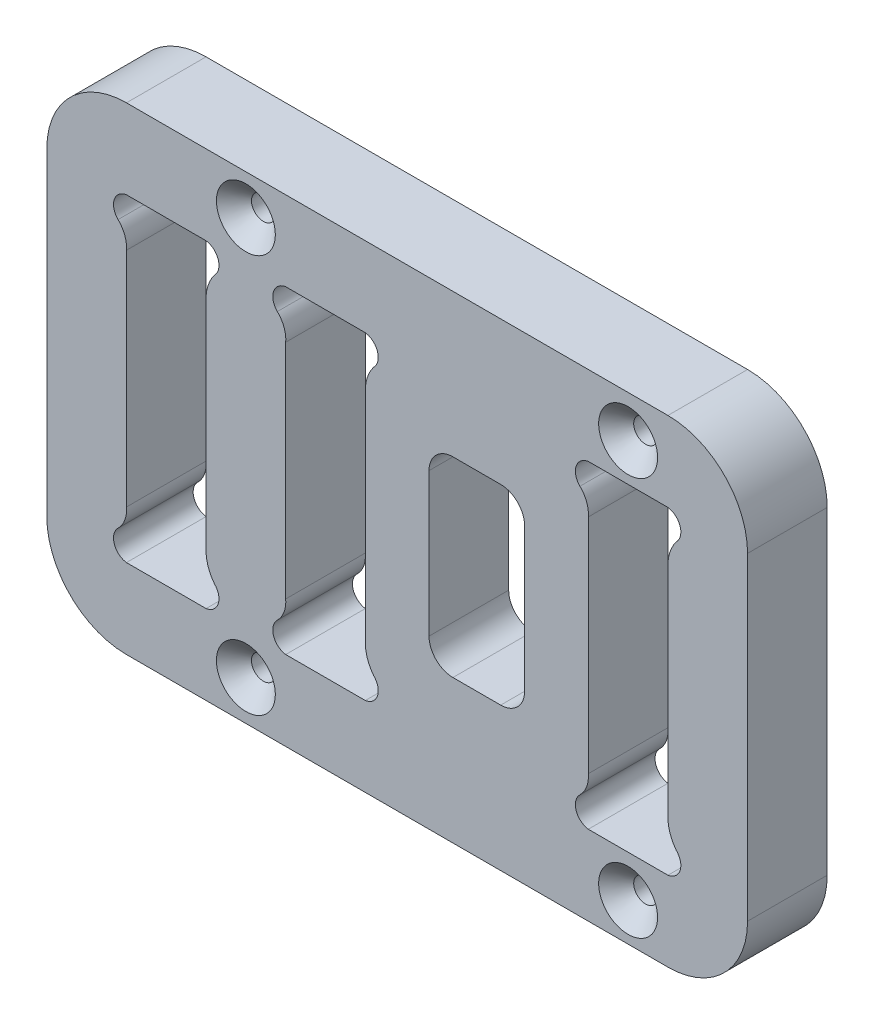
ISO-10303-21;
HEADER;
FILE_DESCRIPTION(('STEP AP214'),'2;1');
FILE_NAME('part.step','',(''),(''),'','','');
FILE_SCHEMA(('AUTOMOTIVE_DESIGN { 1 0 10303 214 1 1 1 1 }'));
ENDSEC;
DATA;
#1=APPLICATION_CONTEXT('core data for automotive mechanical design processes');
#2=APPLICATION_PROTOCOL_DEFINITION('international standard','automotive_design',2000,#1);
#3=PRODUCT_CONTEXT('',#1,'mechanical');
#4=PRODUCT('Part','Part','',(#3));
#5=PRODUCT_RELATED_PRODUCT_CATEGORY('part','',(#4));
#6=PRODUCT_DEFINITION_FORMATION('','',#4);
#7=PRODUCT_DEFINITION_CONTEXT('part definition',#1,'design');
#8=PRODUCT_DEFINITION('design','',#6,#7);
#9=PRODUCT_DEFINITION_SHAPE('','',#8);
#10=(LENGTH_UNIT() NAMED_UNIT(*) SI_UNIT(.MILLI.,.METRE.));
#11=(NAMED_UNIT(*) PLANE_ANGLE_UNIT() SI_UNIT($,.RADIAN.));
#12=(NAMED_UNIT(*) SI_UNIT($,.STERADIAN.) SOLID_ANGLE_UNIT());
#13=UNCERTAINTY_MEASURE_WITH_UNIT(LENGTH_MEASURE(1.E-05),#10,'distance_accuracy_value','');
#14=(GEOMETRIC_REPRESENTATION_CONTEXT(3) GLOBAL_UNCERTAINTY_ASSIGNED_CONTEXT((#13)) GLOBAL_UNIT_ASSIGNED_CONTEXT((#10,
#11,#12)) REPRESENTATION_CONTEXT('',''));
#15=CARTESIAN_POINT('',(0.,0.,0.));
#16=DIRECTION('',(0.,0.,1.));
#17=DIRECTION('',(1.,0.,0.));
#18=AXIS2_PLACEMENT_3D('',#15,#16,#17);
#19=CARTESIAN_POINT('',(-165.488267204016,20.4297528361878,10.));
#20=DIRECTION('',(0.,0.,1.));
#21=DIRECTION('',(1.,0.,0.));
#22=AXIS2_PLACEMENT_3D('',#19,#20,#21);
#23=PLANE('',#22);
#24=CARTESIAN_POINT('',(-118.488267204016,31.4297528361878,10.));
#25=DIRECTION('',(0.,0.,-1.));
#26=DIRECTION('',(-1.,0.,0.));
#27=AXIS2_PLACEMENT_3D('',#24,#25,#26);
#28=CIRCLE('',#27,3.);
#29=CARTESIAN_POINT('',(-115.488267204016,31.4297528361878,10.));
#30=VERTEX_POINT('',#29);
#31=CARTESIAN_POINT('',(-118.488267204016,28.4297528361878,10.));
#32=VERTEX_POINT('',#31);
#33=EDGE_CURVE('E381',#30,#32,#28,.T.);
#34=ORIENTED_EDGE('',*,*,#33,.T.);
#35=DIRECTION('',(-1.,0.,0.));
#36=VECTOR('',#35,1.);
#37=CARTESIAN_POINT('',(-118.488267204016,28.4297528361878,10.));
#38=LINE('',#37,#36);
#39=CARTESIAN_POINT('',(-124.488267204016,28.4297528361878,10.));
#40=VERTEX_POINT('',#39);
#41=EDGE_CURVE('E391',#32,#40,#38,.T.);
#42=ORIENTED_EDGE('',*,*,#41,.T.);
#43=CARTESIAN_POINT('',(-124.488267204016,31.4297528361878,10.));
#44=DIRECTION('',(0.,0.,-1.));
#45=DIRECTION('',(-1.,0.,0.));
#46=AXIS2_PLACEMENT_3D('',#43,#44,#45);
#47=CIRCLE('',#46,3.);
#48=CARTESIAN_POINT('',(-127.488267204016,31.4297528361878,10.));
#49=VERTEX_POINT('',#48);
#50=EDGE_CURVE('E65',#40,#49,#47,.T.);
#51=ORIENTED_EDGE('',*,*,#50,.T.);
#52=DIRECTION('',(0.,1.,0.));
#53=VECTOR('',#52,1.);
#54=CARTESIAN_POINT('',(-127.488267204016,49.4297528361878,10.));
#55=LINE('',#54,#53);
#56=CARTESIAN_POINT('',(-127.488267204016,49.4297528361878,10.));
#57=VERTEX_POINT('',#56);
#58=EDGE_CURVE('E409',#49,#57,#55,.T.);
#59=ORIENTED_EDGE('',*,*,#58,.T.);
#60=CARTESIAN_POINT('',(-124.488267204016,49.4297528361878,10.));
#61=DIRECTION('',(0.,0.,-1.));
#62=DIRECTION('',(1.,0.,0.));
#63=AXIS2_PLACEMENT_3D('',#60,#61,#62);
#64=CIRCLE('',#63,3.);
#65=CARTESIAN_POINT('',(-124.488267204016,52.4297528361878,10.));
#66=VERTEX_POINT('',#65);
#67=EDGE_CURVE('E413',#57,#66,#64,.T.);
#68=ORIENTED_EDGE('',*,*,#67,.T.);
#69=DIRECTION('',(1.,0.,0.));
#70=VECTOR('',#69,1.);
#71=CARTESIAN_POINT('',(-118.488267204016,52.4297528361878,10.));
#72=LINE('',#71,#70);
#73=CARTESIAN_POINT('',(-118.488267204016,52.4297528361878,10.));
#74=VERTEX_POINT('',#73);
#75=EDGE_CURVE('E417',#66,#74,#72,.T.);
#76=ORIENTED_EDGE('',*,*,#75,.T.);
#77=CARTESIAN_POINT('',(-118.488267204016,49.4297528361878,10.));
#78=DIRECTION('',(0.,0.,-1.));
#79=DIRECTION('',(-1.,0.,0.));
#80=AXIS2_PLACEMENT_3D('',#77,#78,#79);
#81=CIRCLE('',#80,3.);
#82=CARTESIAN_POINT('',(-115.488267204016,49.4297528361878,10.));
#83=VERTEX_POINT('',#82);
#84=EDGE_CURVE('E421',#74,#83,#81,.T.);
#85=ORIENTED_EDGE('',*,*,#84,.T.);
#86=DIRECTION('',(0.,-1.,0.));
#87=VECTOR('',#86,1.);
#88=CARTESIAN_POINT('',(-115.488267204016,49.4297528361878,10.));
#89=LINE('',#88,#87);
#90=EDGE_CURVE('E388',#83,#30,#89,.T.);
#91=ORIENTED_EDGE('',*,*,#90,.T.);
#92=EDGE_LOOP('',(#34,#42,#51,#59,#68,#76,#85,#91));
#93=FACE_BOUND('',#92,.T.);
#94=CARTESIAN_POINT('',(-150.488267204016,15.4297528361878,10.));
#95=DIRECTION('',(0.,0.,1.));
#96=DIRECTION('',(1.,0.,0.));
#97=AXIS2_PLACEMENT_3D('',#94,#95,#96);
#98=CIRCLE('',#97,3.69999999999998);
#99=CARTESIAN_POINT('',(-146.788267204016,15.4297528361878,10.));
#100=VERTEX_POINT('',#99);
#101=EDGE_CURVE('E953',#100,#100,#98,.F.);
#102=ORIENTED_EDGE('',*,*,#101,.T.);
#103=EDGE_LOOP('',(#102));
#104=FACE_BOUND('',#103,.T.);
#105=CARTESIAN_POINT('',(-102.488267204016,15.1910066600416,10.));
#106=DIRECTION('',(0.,0.,1.));
#107=DIRECTION('',(1.,0.,0.));
#108=AXIS2_PLACEMENT_3D('',#105,#106,#107);
#109=CIRCLE('',#108,3.69999999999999);
#110=CARTESIAN_POINT('',(-98.7882672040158,15.1910066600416,10.));
#111=VERTEX_POINT('',#110);
#112=EDGE_CURVE('E949',#111,#111,#109,.F.);
#113=ORIENTED_EDGE('',*,*,#112,.T.);
#114=EDGE_LOOP('',(#113));
#115=FACE_BOUND('',#114,.T.);
#116=CARTESIAN_POINT('',(-102.488267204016,65.1910066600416,10.));
#117=DIRECTION('',(0.,0.,1.));
#118=DIRECTION('',(1.,0.,0.));
#119=AXIS2_PLACEMENT_3D('',#116,#117,#118);
#120=CIRCLE('',#119,3.69999999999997);
#121=CARTESIAN_POINT('',(-98.7882672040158,65.1910066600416,10.));
#122=VERTEX_POINT('',#121);
#123=EDGE_CURVE('E945',#122,#122,#120,.F.);
#124=ORIENTED_EDGE('',*,*,#123,.T.);
#125=EDGE_LOOP('',(#124));
#126=FACE_BOUND('',#125,.T.);
#127=CARTESIAN_POINT('',(-150.488267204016,65.4297528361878,10.));
#128=DIRECTION('',(0.,0.,1.));
#129=DIRECTION('',(1.,0.,0.));
#130=AXIS2_PLACEMENT_3D('',#127,#128,#129);
#131=CIRCLE('',#130,3.69999999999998);
#132=CARTESIAN_POINT('',(-146.788267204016,65.4297528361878,10.));
#133=VERTEX_POINT('',#132);
#134=EDGE_CURVE('E941',#133,#133,#131,.F.);
#135=ORIENTED_EDGE('',*,*,#134,.T.);
#136=EDGE_LOOP('',(#135));
#137=FACE_BOUND('',#136,.T.);
#138=CARTESIAN_POINT('',(-92.3946484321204,26.7625940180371,10.));
#139=DIRECTION('',(0.,0.,-1.));
#140=DIRECTION('',(1.,0.,0.));
#141=AXIS2_PLACEMENT_3D('',#138,#139,#140);
#142=CIRCLE('',#141,5.10204081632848);
#143=CARTESIAN_POINT('',(-96.4395042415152,23.6529377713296,10.));
#144=VERTEX_POINT('',#143);
#145=CARTESIAN_POINT('',(-97.4882672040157,26.4695610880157,10.));
#146=VERTEX_POINT('',#145);
#147=EDGE_CURVE('E486',#144,#146,#142,.T.);
#148=ORIENTED_EDGE('',*,*,#147,.F.);
#149=CARTESIAN_POINT('',(-97.754593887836,22.2986266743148,10.));
#150=DIRECTION('',(0.,0.,1.));
#151=DIRECTION('',(1.,0.,0.));
#152=AXIS2_PLACEMENT_3D('',#149,#150,#151);
#153=CIRCLE('',#152,1.88775510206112);
#154=CARTESIAN_POINT('',(-97.4882672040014,20.4297528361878,10.));
#155=VERTEX_POINT('',#154);
#156=EDGE_CURVE('E483',#155,#144,#153,.T.);
#157=ORIENTED_EDGE('',*,*,#156,.F.);
#158=DIRECTION('',(1.,0.,0.));
#159=VECTOR('',#158,1.);
#160=CARTESIAN_POINT('',(-107.48826720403,20.4297528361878,10.));
#161=LINE('',#160,#159);
#162=CARTESIAN_POINT('',(-107.48826720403,20.4297528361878,10.));
#163=VERTEX_POINT('',#162);
#164=EDGE_CURVE('E518',#163,#155,#161,.T.);
#165=ORIENTED_EDGE('',*,*,#164,.F.);
#166=CARTESIAN_POINT('',(-107.221940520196,22.2986266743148,10.));
#167=DIRECTION('',(0.,0.,1.));
#168=DIRECTION('',(-1.,0.,0.));
#169=AXIS2_PLACEMENT_3D('',#166,#167,#168);
#170=CIRCLE('',#169,1.88775510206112);
#171=CARTESIAN_POINT('',(-108.537030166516,23.6529377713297,10.));
#172=VERTEX_POINT('',#171);
#173=EDGE_CURVE('E514',#172,#163,#170,.T.);
#174=ORIENTED_EDGE('',*,*,#173,.F.);
#175=CARTESIAN_POINT('',(-110.975997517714,26.1646452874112,10.));
#176=DIRECTION('',(0.,0.,-1.));
#177=DIRECTION('',(-1.,0.,0.));
#178=AXIS2_PLACEMENT_3D('',#175,#176,#177);
#179=CIRCLE('',#178,3.50103361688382);
#180=CARTESIAN_POINT('',(-107.488267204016,26.4695610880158,10.));
#181=VERTEX_POINT('',#180);
#182=EDGE_CURVE('E511',#181,#172,#179,.T.);
#183=ORIENTED_EDGE('',*,*,#182,.F.);
#184=DIRECTION('',(0.,-1.,0.));
#185=VECTOR('',#184,1.);
#186=CARTESIAN_POINT('',(-107.488267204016,54.3899445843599,10.));
#187=LINE('',#186,#185);
#188=CARTESIAN_POINT('',(-107.488267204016,54.3899445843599,10.));
#189=VERTEX_POINT('',#188);
#190=EDGE_CURVE('E508',#189,#181,#187,.T.);
#191=ORIENTED_EDGE('',*,*,#190,.F.);
#192=CARTESIAN_POINT('',(-110.975997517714,54.6948603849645,10.));
#193=DIRECTION('',(0.,0.,-1.));
#194=DIRECTION('',(1.,0.,0.));
#195=AXIS2_PLACEMENT_3D('',#192,#193,#194);
#196=CIRCLE('',#195,3.50103361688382);
#197=CARTESIAN_POINT('',(-108.537030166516,57.206567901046,10.));
#198=VERTEX_POINT('',#197);
#199=EDGE_CURVE('E505',#198,#189,#196,.T.);
#200=ORIENTED_EDGE('',*,*,#199,.F.);
#201=CARTESIAN_POINT('',(-107.221940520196,58.5608789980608,10.));
#202=DIRECTION('',(0.,0.,1.));
#203=DIRECTION('',(1.,0.,0.));
#204=AXIS2_PLACEMENT_3D('',#201,#202,#203);
#205=CIRCLE('',#204,1.88775510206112);
#206=CARTESIAN_POINT('',(-107.48826720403,60.4297528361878,10.));
#207=VERTEX_POINT('',#206);
#208=EDGE_CURVE('E502',#207,#198,#205,.T.);
#209=ORIENTED_EDGE('',*,*,#208,.F.);
#210=DIRECTION('',(-1.,0.,0.));
#211=VECTOR('',#210,1.);
#212=CARTESIAN_POINT('',(-107.48826720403,60.4297528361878,10.));
#213=LINE('',#212,#211);
#214=CARTESIAN_POINT('',(-97.4882672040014,60.4297528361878,10.));
#215=VERTEX_POINT('',#214);
#216=EDGE_CURVE('E499',#215,#207,#213,.T.);
#217=ORIENTED_EDGE('',*,*,#216,.F.);
#218=CARTESIAN_POINT('',(-97.754593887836,58.5608789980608,10.));
#219=DIRECTION('',(0.,0.,1.));
#220=DIRECTION('',(-1.,0.,0.));
#221=AXIS2_PLACEMENT_3D('',#218,#219,#220);
#222=CIRCLE('',#221,1.88775510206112);
#223=CARTESIAN_POINT('',(-96.4395042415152,57.206567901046,10.));
#224=VERTEX_POINT('',#223);
#225=EDGE_CURVE('E496',#224,#215,#222,.T.);
#226=ORIENTED_EDGE('',*,*,#225,.F.);
#227=CARTESIAN_POINT('',(-92.3946484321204,54.0969116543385,10.));
#228=DIRECTION('',(0.,0.,-1.));
#229=DIRECTION('',(-1.,0.,0.));
#230=AXIS2_PLACEMENT_3D('',#227,#228,#229);
#231=CIRCLE('',#230,5.10204081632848);
#232=CARTESIAN_POINT('',(-97.4882672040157,54.3899445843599,10.));
#233=VERTEX_POINT('',#232);
#234=EDGE_CURVE('E493',#233,#224,#231,.T.);
#235=ORIENTED_EDGE('',*,*,#234,.F.);
#236=DIRECTION('',(0.,1.,0.));
#237=VECTOR('',#236,1.);
#238=CARTESIAN_POINT('',(-97.4882672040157,54.3899445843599,10.));
#239=LINE('',#238,#237);
#240=EDGE_CURVE('E490',#146,#233,#239,.T.);
#241=ORIENTED_EDGE('',*,*,#240,.F.);
#242=EDGE_LOOP('',(#148,#157,#165,#174,#183,#191,#200,#209,#217,#226,#235,#241));
#243=FACE_BOUND('',#242,.T.);
#244=CARTESIAN_POINT('',(-165.488267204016,20.4297528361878,10.));
#245=DIRECTION('',(0.,0.,1.));
#246=DIRECTION('',(1.,0.,0.));
#247=AXIS2_PLACEMENT_3D('',#244,#245,#246);
#248=CIRCLE('',#247,10.);
#249=CARTESIAN_POINT('',(-175.488267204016,20.4297528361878,10.));
#250=VERTEX_POINT('',#249);
#251=CARTESIAN_POINT('',(-165.488267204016,10.4297528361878,10.));
#252=VERTEX_POINT('',#251);
#253=EDGE_CURVE('E856',#250,#252,#248,.T.);
#254=ORIENTED_EDGE('',*,*,#253,.T.);
#255=DIRECTION('',(1.,0.,0.));
#256=VECTOR('',#255,1.);
#257=CARTESIAN_POINT('',(-165.488267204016,10.4297528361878,10.));
#258=LINE('',#257,#256);
#259=CARTESIAN_POINT('',(-97.4882672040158,10.4297528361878,10.));
#260=VERTEX_POINT('',#259);
#261=EDGE_CURVE('E860',#252,#260,#258,.T.);
#262=ORIENTED_EDGE('',*,*,#261,.T.);
#263=CARTESIAN_POINT('',(-97.4882672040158,20.4297528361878,10.));
#264=DIRECTION('',(0.,0.,1.));
#265=DIRECTION('',(-1.,0.,0.));
#266=AXIS2_PLACEMENT_3D('',#263,#264,#265);
#267=CIRCLE('',#266,10.);
#268=CARTESIAN_POINT('',(-87.4882672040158,20.4297528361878,10.));
#269=VERTEX_POINT('',#268);
#270=EDGE_CURVE('E864',#260,#269,#267,.T.);
#271=ORIENTED_EDGE('',*,*,#270,.T.);
#272=DIRECTION('',(0.,1.,0.));
#273=VECTOR('',#272,1.);
#274=CARTESIAN_POINT('',(-87.4882672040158,20.4297528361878,10.));
#275=LINE('',#274,#273);
#276=CARTESIAN_POINT('',(-87.4882672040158,60.4297528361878,10.));
#277=VERTEX_POINT('',#276);
#278=EDGE_CURVE('E867',#269,#277,#275,.T.);
#279=ORIENTED_EDGE('',*,*,#278,.T.);
#280=CARTESIAN_POINT('',(-97.4882672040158,60.4297528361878,10.));
#281=DIRECTION('',(0.,0.,1.));
#282=DIRECTION('',(1.,0.,0.));
#283=AXIS2_PLACEMENT_3D('',#280,#281,#282);
#284=CIRCLE('',#283,10.);
#285=CARTESIAN_POINT('',(-97.4882672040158,70.4297528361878,10.));
#286=VERTEX_POINT('',#285);
#287=EDGE_CURVE('E870',#277,#286,#284,.T.);
#288=ORIENTED_EDGE('',*,*,#287,.T.);
#289=DIRECTION('',(-1.,0.,0.));
#290=VECTOR('',#289,1.);
#291=CARTESIAN_POINT('',(-165.488267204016,70.4297528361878,10.));
#292=LINE('',#291,#290);
#293=CARTESIAN_POINT('',(-165.488267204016,70.4297528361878,10.));
#294=VERTEX_POINT('',#293);
#295=EDGE_CURVE('E873',#286,#294,#292,.T.);
#296=ORIENTED_EDGE('',*,*,#295,.T.);
#297=CARTESIAN_POINT('',(-165.488267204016,60.4297528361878,10.));
#298=DIRECTION('',(0.,0.,1.));
#299=DIRECTION('',(-1.,0.,0.));
#300=AXIS2_PLACEMENT_3D('',#297,#298,#299);
#301=CIRCLE('',#300,10.);
#302=CARTESIAN_POINT('',(-175.488267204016,60.4297528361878,10.));
#303=VERTEX_POINT('',#302);
#304=EDGE_CURVE('E876',#294,#303,#301,.T.);
#305=ORIENTED_EDGE('',*,*,#304,.T.);
#306=DIRECTION('',(0.,-1.,0.));
#307=VECTOR('',#306,1.);
#308=CARTESIAN_POINT('',(-175.488267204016,60.4297528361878,10.));
#309=LINE('',#308,#307);
#310=EDGE_CURVE('E879',#303,#250,#309,.T.);
#311=ORIENTED_EDGE('',*,*,#310,.T.);
#312=EDGE_LOOP('',(#254,#262,#271,#279,#288,#296,#305,#311));
#313=FACE_BOUND('',#312,.T.);
#314=CARTESIAN_POINT('',(-130.39464843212,26.7625940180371,10.));
#315=DIRECTION('',(0.,0.,-1.));
#316=DIRECTION('',(1.,0.,0.));
#317=AXIS2_PLACEMENT_3D('',#314,#315,#316);
#318=CIRCLE('',#317,5.10204081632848);
#319=CARTESIAN_POINT('',(-134.439504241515,23.6529377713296,10.));
#320=VERTEX_POINT('',#319);
#321=CARTESIAN_POINT('',(-135.488267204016,26.4695610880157,10.));
#322=VERTEX_POINT('',#321);
#323=EDGE_CURVE('E736',#320,#322,#318,.T.);
#324=ORIENTED_EDGE('',*,*,#323,.F.);
#325=CARTESIAN_POINT('',(-135.754593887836,22.2986266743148,10.));
#326=DIRECTION('',(0.,0.,1.));
#327=DIRECTION('',(1.,0.,0.));
#328=AXIS2_PLACEMENT_3D('',#325,#326,#327);
#329=CIRCLE('',#328,1.88775510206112);
#330=CARTESIAN_POINT('',(-135.488267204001,20.4297528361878,10.));
#331=VERTEX_POINT('',#330);
#332=EDGE_CURVE('E733',#331,#320,#329,.T.);
#333=ORIENTED_EDGE('',*,*,#332,.F.);
#334=DIRECTION('',(1.,0.,0.));
#335=VECTOR('',#334,1.);
#336=CARTESIAN_POINT('',(-145.48826720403,20.4297528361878,10.));
#337=LINE('',#336,#335);
#338=CARTESIAN_POINT('',(-145.48826720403,20.4297528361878,10.));
#339=VERTEX_POINT('',#338);
#340=EDGE_CURVE('E768',#339,#331,#337,.T.);
#341=ORIENTED_EDGE('',*,*,#340,.F.);
#342=CARTESIAN_POINT('',(-145.221940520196,22.2986266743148,10.));
#343=DIRECTION('',(0.,0.,1.));
#344=DIRECTION('',(-1.,0.,0.));
#345=AXIS2_PLACEMENT_3D('',#342,#343,#344);
#346=CIRCLE('',#345,1.88775510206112);
#347=CARTESIAN_POINT('',(-146.537030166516,23.6529377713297,10.));
#348=VERTEX_POINT('',#347);
#349=EDGE_CURVE('E764',#348,#339,#346,.T.);
#350=ORIENTED_EDGE('',*,*,#349,.F.);
#351=CARTESIAN_POINT('',(-148.975997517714,26.1646452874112,10.));
#352=DIRECTION('',(0.,0.,-1.));
#353=DIRECTION('',(-1.,0.,0.));
#354=AXIS2_PLACEMENT_3D('',#351,#352,#353);
#355=CIRCLE('',#354,3.50103361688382);
#356=CARTESIAN_POINT('',(-145.488267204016,26.4695610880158,10.));
#357=VERTEX_POINT('',#356);
#358=EDGE_CURVE('E761',#357,#348,#355,.T.);
#359=ORIENTED_EDGE('',*,*,#358,.F.);
#360=DIRECTION('',(0.,-1.,0.));
#361=VECTOR('',#360,1.);
#362=CARTESIAN_POINT('',(-145.488267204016,54.3899445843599,10.));
#363=LINE('',#362,#361);
#364=CARTESIAN_POINT('',(-145.488267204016,54.3899445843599,10.));
#365=VERTEX_POINT('',#364);
#366=EDGE_CURVE('E758',#365,#357,#363,.T.);
#367=ORIENTED_EDGE('',*,*,#366,.F.);
#368=CARTESIAN_POINT('',(-148.975997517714,54.6948603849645,10.));
#369=DIRECTION('',(0.,0.,-1.));
#370=DIRECTION('',(1.,0.,0.));
#371=AXIS2_PLACEMENT_3D('',#368,#369,#370);
#372=CIRCLE('',#371,3.50103361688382);
#373=CARTESIAN_POINT('',(-146.537030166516,57.206567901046,10.));
#374=VERTEX_POINT('',#373);
#375=EDGE_CURVE('E755',#374,#365,#372,.T.);
#376=ORIENTED_EDGE('',*,*,#375,.F.);
#377=CARTESIAN_POINT('',(-145.221940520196,58.5608789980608,10.));
#378=DIRECTION('',(0.,0.,1.));
#379=DIRECTION('',(1.,0.,0.));
#380=AXIS2_PLACEMENT_3D('',#377,#378,#379);
#381=CIRCLE('',#380,1.88775510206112);
#382=CARTESIAN_POINT('',(-145.48826720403,60.4297528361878,10.));
#383=VERTEX_POINT('',#382);
#384=EDGE_CURVE('E752',#383,#374,#381,.T.);
#385=ORIENTED_EDGE('',*,*,#384,.F.);
#386=DIRECTION('',(-1.,0.,0.));
#387=VECTOR('',#386,1.);
#388=CARTESIAN_POINT('',(-145.48826720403,60.4297528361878,10.));
#389=LINE('',#388,#387);
#390=CARTESIAN_POINT('',(-135.488267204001,60.4297528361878,10.));
#391=VERTEX_POINT('',#390);
#392=EDGE_CURVE('E749',#391,#383,#389,.T.);
#393=ORIENTED_EDGE('',*,*,#392,.F.);
#394=CARTESIAN_POINT('',(-135.754593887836,58.5608789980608,10.));
#395=DIRECTION('',(0.,0.,1.));
#396=DIRECTION('',(-1.,0.,0.));
#397=AXIS2_PLACEMENT_3D('',#394,#395,#396);
#398=CIRCLE('',#397,1.88775510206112);
#399=CARTESIAN_POINT('',(-134.439504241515,57.206567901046,10.));
#400=VERTEX_POINT('',#399);
#401=EDGE_CURVE('E746',#400,#391,#398,.T.);
#402=ORIENTED_EDGE('',*,*,#401,.F.);
#403=CARTESIAN_POINT('',(-130.39464843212,54.0969116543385,10.));
#404=DIRECTION('',(0.,0.,-1.));
#405=DIRECTION('',(-1.,0.,0.));
#406=AXIS2_PLACEMENT_3D('',#403,#404,#405);
#407=CIRCLE('',#406,5.10204081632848);
#408=CARTESIAN_POINT('',(-135.488267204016,54.3899445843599,10.));
#409=VERTEX_POINT('',#408);
#410=EDGE_CURVE('E743',#409,#400,#407,.T.);
#411=ORIENTED_EDGE('',*,*,#410,.F.);
#412=DIRECTION('',(0.,1.,0.));
#413=VECTOR('',#412,1.);
#414=CARTESIAN_POINT('',(-135.488267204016,54.3899445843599,10.));
#415=LINE('',#414,#413);
#416=EDGE_CURVE('E740',#322,#409,#415,.T.);
#417=ORIENTED_EDGE('',*,*,#416,.F.);
#418=EDGE_LOOP('',(#324,#333,#341,#350,#359,#367,#376,#385,#393,#402,#411,#417));
#419=FACE_BOUND('',#418,.T.);
#420=CARTESIAN_POINT('',(-150.39464843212,26.7625940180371,10.));
#421=DIRECTION('',(0.,0.,-1.));
#422=DIRECTION('',(1.,0.,0.));
#423=AXIS2_PLACEMENT_3D('',#420,#421,#422);
#424=CIRCLE('',#423,5.10204081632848);
#425=CARTESIAN_POINT('',(-154.439504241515,23.6529377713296,10.));
#426=VERTEX_POINT('',#425);
#427=CARTESIAN_POINT('',(-155.488267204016,26.4695610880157,10.));
#428=VERTEX_POINT('',#427);
#429=EDGE_CURVE('E613',#426,#428,#424,.T.);
#430=ORIENTED_EDGE('',*,*,#429,.F.);
#431=CARTESIAN_POINT('',(-155.754593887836,22.2986266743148,10.));
#432=DIRECTION('',(0.,0.,1.));
#433=DIRECTION('',(1.,0.,0.));
#434=AXIS2_PLACEMENT_3D('',#431,#432,#433);
#435=CIRCLE('',#434,1.88775510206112);
#436=CARTESIAN_POINT('',(-155.488267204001,20.4297528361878,10.));
#437=VERTEX_POINT('',#436);
#438=EDGE_CURVE('E610',#437,#426,#435,.T.);
#439=ORIENTED_EDGE('',*,*,#438,.F.);
#440=DIRECTION('',(1.,0.,0.));
#441=VECTOR('',#440,1.);
#442=CARTESIAN_POINT('',(-165.48826720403,20.4297528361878,10.));
#443=LINE('',#442,#441);
#444=CARTESIAN_POINT('',(-165.48826720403,20.4297528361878,10.));
#445=VERTEX_POINT('',#444);
#446=EDGE_CURVE('E645',#445,#437,#443,.T.);
#447=ORIENTED_EDGE('',*,*,#446,.F.);
#448=CARTESIAN_POINT('',(-165.221940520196,22.2986266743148,10.));
#449=DIRECTION('',(0.,0.,1.));
#450=DIRECTION('',(-1.,0.,0.));
#451=AXIS2_PLACEMENT_3D('',#448,#449,#450);
#452=CIRCLE('',#451,1.88775510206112);
#453=CARTESIAN_POINT('',(-166.537030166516,23.6529377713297,10.));
#454=VERTEX_POINT('',#453);
#455=EDGE_CURVE('E641',#454,#445,#452,.T.);
#456=ORIENTED_EDGE('',*,*,#455,.F.);
#457=CARTESIAN_POINT('',(-168.975997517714,26.1646452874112,10.));
#458=DIRECTION('',(0.,0.,-1.));
#459=DIRECTION('',(-1.,0.,0.));
#460=AXIS2_PLACEMENT_3D('',#457,#458,#459);
#461=CIRCLE('',#460,3.50103361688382);
#462=CARTESIAN_POINT('',(-165.488267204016,26.4695610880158,10.));
#463=VERTEX_POINT('',#462);
#464=EDGE_CURVE('E638',#463,#454,#461,.T.);
#465=ORIENTED_EDGE('',*,*,#464,.F.);
#466=DIRECTION('',(0.,-1.,0.));
#467=VECTOR('',#466,1.);
#468=CARTESIAN_POINT('',(-165.488267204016,54.3899445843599,10.));
#469=LINE('',#468,#467);
#470=CARTESIAN_POINT('',(-165.488267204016,54.3899445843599,10.));
#471=VERTEX_POINT('',#470);
#472=EDGE_CURVE('E635',#471,#463,#469,.T.);
#473=ORIENTED_EDGE('',*,*,#472,.F.);
#474=CARTESIAN_POINT('',(-168.975997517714,54.6948603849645,10.));
#475=DIRECTION('',(0.,0.,-1.));
#476=DIRECTION('',(1.,0.,0.));
#477=AXIS2_PLACEMENT_3D('',#474,#475,#476);
#478=CIRCLE('',#477,3.50103361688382);
#479=CARTESIAN_POINT('',(-166.537030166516,57.206567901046,10.));
#480=VERTEX_POINT('',#479);
#481=EDGE_CURVE('E632',#480,#471,#478,.T.);
#482=ORIENTED_EDGE('',*,*,#481,.F.);
#483=CARTESIAN_POINT('',(-165.221940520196,58.5608789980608,10.));
#484=DIRECTION('',(0.,0.,1.));
#485=DIRECTION('',(1.,0.,0.));
#486=AXIS2_PLACEMENT_3D('',#483,#484,#485);
#487=CIRCLE('',#486,1.88775510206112);
#488=CARTESIAN_POINT('',(-165.48826720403,60.4297528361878,10.));
#489=VERTEX_POINT('',#488);
#490=EDGE_CURVE('E629',#489,#480,#487,.T.);
#491=ORIENTED_EDGE('',*,*,#490,.F.);
#492=DIRECTION('',(-1.,0.,0.));
#493=VECTOR('',#492,1.);
#494=CARTESIAN_POINT('',(-165.48826720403,60.4297528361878,10.));
#495=LINE('',#494,#493);
#496=CARTESIAN_POINT('',(-155.488267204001,60.4297528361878,10.));
#497=VERTEX_POINT('',#496);
#498=EDGE_CURVE('E626',#497,#489,#495,.T.);
#499=ORIENTED_EDGE('',*,*,#498,.F.);
#500=CARTESIAN_POINT('',(-155.754593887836,58.5608789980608,10.));
#501=DIRECTION('',(0.,0.,1.));
#502=DIRECTION('',(-1.,0.,0.));
#503=AXIS2_PLACEMENT_3D('',#500,#501,#502);
#504=CIRCLE('',#503,1.88775510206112);
#505=CARTESIAN_POINT('',(-154.439504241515,57.206567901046,10.));
#506=VERTEX_POINT('',#505);
#507=EDGE_CURVE('E623',#506,#497,#504,.T.);
#508=ORIENTED_EDGE('',*,*,#507,.F.);
#509=CARTESIAN_POINT('',(-150.39464843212,54.0969116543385,10.));
#510=DIRECTION('',(0.,0.,-1.));
#511=DIRECTION('',(-1.,0.,0.));
#512=AXIS2_PLACEMENT_3D('',#509,#510,#511);
#513=CIRCLE('',#512,5.10204081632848);
#514=CARTESIAN_POINT('',(-155.488267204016,54.3899445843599,10.));
#515=VERTEX_POINT('',#514);
#516=EDGE_CURVE('E620',#515,#506,#513,.T.);
#517=ORIENTED_EDGE('',*,*,#516,.F.);
#518=DIRECTION('',(0.,1.,0.));
#519=VECTOR('',#518,1.);
#520=CARTESIAN_POINT('',(-155.488267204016,54.3899445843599,10.));
#521=LINE('',#520,#519);
#522=EDGE_CURVE('E617',#428,#515,#521,.T.);
#523=ORIENTED_EDGE('',*,*,#522,.F.);
#524=EDGE_LOOP('',(#430,#439,#447,#456,#465,#473,#482,#491,#499,#508,#517,#523));
#525=FACE_BOUND('',#524,.T.);
#526=ADVANCED_FACE('F48',(#93,#104,#115,#126,#137,#243,#313,#419,#525),#23,.T.);
#527=CARTESIAN_POINT('',(-165.488267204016,20.4297528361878,0.));
#528=DIRECTION('',(0.,0.,1.));
#529=DIRECTION('',(1.,0.,0.));
#530=AXIS2_PLACEMENT_3D('',#527,#528,#529);
#531=PLANE('',#530);
#532=DIRECTION('',(-1.,0.,0.));
#533=VECTOR('',#532,1.);
#534=CARTESIAN_POINT('',(-118.488267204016,28.4297528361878,0.));
#535=LINE('',#534,#533);
#536=CARTESIAN_POINT('',(-118.488267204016,28.4297528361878,0.));
#537=VERTEX_POINT('',#536);
#538=CARTESIAN_POINT('',(-124.488267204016,28.4297528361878,0.));
#539=VERTEX_POINT('',#538);
#540=EDGE_CURVE('E428',#537,#539,#535,.T.);
#541=ORIENTED_EDGE('',*,*,#540,.F.);
#542=CARTESIAN_POINT('',(-118.488267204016,31.4297528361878,0.));
#543=DIRECTION('',(0.,0.,-1.));
#544=DIRECTION('',(-1.,0.,0.));
#545=AXIS2_PLACEMENT_3D('',#542,#543,#544);
#546=CIRCLE('',#545,3.);
#547=CARTESIAN_POINT('',(-115.488267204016,31.4297528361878,0.));
#548=VERTEX_POINT('',#547);
#549=EDGE_CURVE('E73',#548,#537,#546,.T.);
#550=ORIENTED_EDGE('',*,*,#549,.F.);
#551=DIRECTION('',(0.,-1.,0.));
#552=VECTOR('',#551,1.);
#553=CARTESIAN_POINT('',(-115.488267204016,49.4297528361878,0.));
#554=LINE('',#553,#552);
#555=CARTESIAN_POINT('',(-115.488267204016,49.4297528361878,0.));
#556=VERTEX_POINT('',#555);
#557=EDGE_CURVE('E400',#556,#548,#554,.T.);
#558=ORIENTED_EDGE('',*,*,#557,.F.);
#559=CARTESIAN_POINT('',(-118.488267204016,49.4297528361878,0.));
#560=DIRECTION('',(0.,0.,-1.));
#561=DIRECTION('',(-1.,0.,0.));
#562=AXIS2_PLACEMENT_3D('',#559,#560,#561);
#563=CIRCLE('',#562,3.);
#564=CARTESIAN_POINT('',(-118.488267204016,52.4297528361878,0.));
#565=VERTEX_POINT('',#564);
#566=EDGE_CURVE('E404',#565,#556,#563,.T.);
#567=ORIENTED_EDGE('',*,*,#566,.F.);
#568=DIRECTION('',(1.,0.,0.));
#569=VECTOR('',#568,1.);
#570=CARTESIAN_POINT('',(-118.488267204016,52.4297528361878,0.));
#571=LINE('',#570,#569);
#572=CARTESIAN_POINT('',(-124.488267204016,52.4297528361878,0.));
#573=VERTEX_POINT('',#572);
#574=EDGE_CURVE('E443',#573,#565,#571,.T.);
#575=ORIENTED_EDGE('',*,*,#574,.F.);
#576=CARTESIAN_POINT('',(-124.488267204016,49.4297528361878,0.));
#577=DIRECTION('',(0.,0.,-1.));
#578=DIRECTION('',(1.,0.,0.));
#579=AXIS2_PLACEMENT_3D('',#576,#577,#578);
#580=CIRCLE('',#579,3.);
#581=CARTESIAN_POINT('',(-127.488267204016,49.4297528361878,0.));
#582=VERTEX_POINT('',#581);
#583=EDGE_CURVE('E439',#582,#573,#580,.T.);
#584=ORIENTED_EDGE('',*,*,#583,.F.);
#585=DIRECTION('',(0.,1.,0.));
#586=VECTOR('',#585,1.);
#587=CARTESIAN_POINT('',(-127.488267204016,49.4297528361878,0.));
#588=LINE('',#587,#586);
#589=CARTESIAN_POINT('',(-127.488267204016,31.4297528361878,0.));
#590=VERTEX_POINT('',#589);
#591=EDGE_CURVE('E435',#590,#582,#588,.T.);
#592=ORIENTED_EDGE('',*,*,#591,.F.);
#593=CARTESIAN_POINT('',(-124.488267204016,31.4297528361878,0.));
#594=DIRECTION('',(0.,0.,-1.));
#595=DIRECTION('',(-1.,0.,0.));
#596=AXIS2_PLACEMENT_3D('',#593,#594,#595);
#597=CIRCLE('',#596,3.);
#598=EDGE_CURVE('E431',#539,#590,#597,.T.);
#599=ORIENTED_EDGE('',*,*,#598,.F.);
#600=EDGE_LOOP('',(#541,#550,#558,#567,#575,#584,#592,#599));
#601=FACE_BOUND('',#600,.T.);
#602=CARTESIAN_POINT('',(-150.488267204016,65.4297528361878,0.));
#603=DIRECTION('',(0.,0.,1.));
#604=DIRECTION('',(1.,0.,0.));
#605=AXIS2_PLACEMENT_3D('',#602,#603,#604);
#606=CIRCLE('',#605,1.5);
#607=CARTESIAN_POINT('',(-148.988267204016,65.4297528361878,0.));
#608=VERTEX_POINT('',#607);
#609=EDGE_CURVE('E605',#608,#608,#606,.T.);
#610=ORIENTED_EDGE('',*,*,#609,.T.);
#611=EDGE_LOOP('',(#610));
#612=FACE_BOUND('',#611,.T.);
#613=CARTESIAN_POINT('',(-155.754593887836,22.2986266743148,0.));
#614=DIRECTION('',(0.,0.,1.));
#615=DIRECTION('',(1.,0.,0.));
#616=AXIS2_PLACEMENT_3D('',#613,#614,#615);
#617=CIRCLE('',#616,1.88775510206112);
#618=CARTESIAN_POINT('',(-155.488267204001,20.4297528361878,0.));
#619=VERTEX_POINT('',#618);
#620=CARTESIAN_POINT('',(-154.439504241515,23.6529377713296,0.));
#621=VERTEX_POINT('',#620);
#622=EDGE_CURVE('E609',#619,#621,#617,.T.);
#623=ORIENTED_EDGE('',*,*,#622,.T.);
#624=CARTESIAN_POINT('',(-150.39464843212,26.7625940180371,0.));
#625=DIRECTION('',(0.,0.,-1.));
#626=DIRECTION('',(1.,0.,0.));
#627=AXIS2_PLACEMENT_3D('',#624,#625,#626);
#628=CIRCLE('',#627,5.10204081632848);
#629=CARTESIAN_POINT('',(-155.488267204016,26.4695610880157,0.));
#630=VERTEX_POINT('',#629);
#631=EDGE_CURVE('E652',#621,#630,#628,.T.);
#632=ORIENTED_EDGE('',*,*,#631,.T.);
#633=DIRECTION('',(0.,1.,0.));
#634=VECTOR('',#633,1.);
#635=CARTESIAN_POINT('',(-155.488267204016,54.3899445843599,0.));
#636=LINE('',#635,#634);
#637=CARTESIAN_POINT('',(-155.488267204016,54.3899445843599,0.));
#638=VERTEX_POINT('',#637);
#639=EDGE_CURVE('E656',#630,#638,#636,.T.);
#640=ORIENTED_EDGE('',*,*,#639,.T.);
#641=CARTESIAN_POINT('',(-150.39464843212,54.0969116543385,0.));
#642=DIRECTION('',(0.,0.,-1.));
#643=DIRECTION('',(-1.,0.,0.));
#644=AXIS2_PLACEMENT_3D('',#641,#642,#643);
#645=CIRCLE('',#644,5.10204081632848);
#646=CARTESIAN_POINT('',(-154.439504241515,57.206567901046,0.));
#647=VERTEX_POINT('',#646);
#648=EDGE_CURVE('E660',#638,#647,#645,.T.);
#649=ORIENTED_EDGE('',*,*,#648,.T.);
#650=CARTESIAN_POINT('',(-155.754593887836,58.5608789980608,0.));
#651=DIRECTION('',(0.,0.,1.));
#652=DIRECTION('',(-1.,0.,0.));
#653=AXIS2_PLACEMENT_3D('',#650,#651,#652);
#654=CIRCLE('',#653,1.88775510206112);
#655=CARTESIAN_POINT('',(-155.488267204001,60.4297528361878,0.));
#656=VERTEX_POINT('',#655);
#657=EDGE_CURVE('E664',#647,#656,#654,.T.);
#658=ORIENTED_EDGE('',*,*,#657,.T.);
#659=DIRECTION('',(-1.,0.,0.));
#660=VECTOR('',#659,1.);
#661=CARTESIAN_POINT('',(-165.48826720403,60.4297528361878,0.));
#662=LINE('',#661,#660);
#663=CARTESIAN_POINT('',(-165.48826720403,60.4297528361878,0.));
#664=VERTEX_POINT('',#663);
#665=EDGE_CURVE('E668',#656,#664,#662,.T.);
#666=ORIENTED_EDGE('',*,*,#665,.T.);
#667=CARTESIAN_POINT('',(-165.221940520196,58.5608789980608,0.));
#668=DIRECTION('',(0.,0.,1.));
#669=DIRECTION('',(1.,0.,0.));
#670=AXIS2_PLACEMENT_3D('',#667,#668,#669);
#671=CIRCLE('',#670,1.88775510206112);
#672=CARTESIAN_POINT('',(-166.537030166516,57.206567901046,0.));
#673=VERTEX_POINT('',#672);
#674=EDGE_CURVE('E672',#664,#673,#671,.T.);
#675=ORIENTED_EDGE('',*,*,#674,.T.);
#676=CARTESIAN_POINT('',(-168.975997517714,54.6948603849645,0.));
#677=DIRECTION('',(0.,0.,-1.));
#678=DIRECTION('',(1.,0.,0.));
#679=AXIS2_PLACEMENT_3D('',#676,#677,#678);
#680=CIRCLE('',#679,3.50103361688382);
#681=CARTESIAN_POINT('',(-165.488267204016,54.3899445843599,0.));
#682=VERTEX_POINT('',#681);
#683=EDGE_CURVE('E676',#673,#682,#680,.T.);
#684=ORIENTED_EDGE('',*,*,#683,.T.);
#685=DIRECTION('',(0.,-1.,0.));
#686=VECTOR('',#685,1.);
#687=CARTESIAN_POINT('',(-165.488267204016,54.3899445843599,0.));
#688=LINE('',#687,#686);
#689=CARTESIAN_POINT('',(-165.488267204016,26.4695610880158,0.));
#690=VERTEX_POINT('',#689);
#691=EDGE_CURVE('E680',#682,#690,#688,.T.);
#692=ORIENTED_EDGE('',*,*,#691,.T.);
#693=CARTESIAN_POINT('',(-168.975997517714,26.1646452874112,0.));
#694=DIRECTION('',(0.,0.,-1.));
#695=DIRECTION('',(-1.,0.,0.));
#696=AXIS2_PLACEMENT_3D('',#693,#694,#695);
#697=CIRCLE('',#696,3.50103361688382);
#698=CARTESIAN_POINT('',(-166.537030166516,23.6529377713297,0.));
#699=VERTEX_POINT('',#698);
#700=EDGE_CURVE('E684',#690,#699,#697,.T.);
#701=ORIENTED_EDGE('',*,*,#700,.T.);
#702=CARTESIAN_POINT('',(-165.221940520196,22.2986266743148,0.));
#703=DIRECTION('',(0.,0.,1.));
#704=DIRECTION('',(-1.,0.,0.));
#705=AXIS2_PLACEMENT_3D('',#702,#703,#704);
#706=CIRCLE('',#705,1.88775510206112);
#707=CARTESIAN_POINT('',(-165.48826720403,20.4297528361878,0.));
#708=VERTEX_POINT('',#707);
#709=EDGE_CURVE('E688',#699,#708,#706,.T.);
#710=ORIENTED_EDGE('',*,*,#709,.T.);
#711=DIRECTION('',(1.,0.,0.));
#712=VECTOR('',#711,1.);
#713=CARTESIAN_POINT('',(-165.48826720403,20.4297528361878,0.));
#714=LINE('',#713,#712);
#715=EDGE_CURVE('E614',#708,#619,#714,.T.);
#716=ORIENTED_EDGE('',*,*,#715,.T.);
#717=EDGE_LOOP('',(#623,#632,#640,#649,#658,#666,#675,#684,#692,#701,#710,#716));
#718=FACE_BOUND('',#717,.T.);
#719=CARTESIAN_POINT('',(-165.488267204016,20.4297528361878,0.));
#720=DIRECTION('',(0.,0.,1.));
#721=DIRECTION('',(1.,0.,0.));
#722=AXIS2_PLACEMENT_3D('',#719,#720,#721);
#723=CIRCLE('',#722,10.);
#724=CARTESIAN_POINT('',(-175.488267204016,20.4297528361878,0.));
#725=VERTEX_POINT('',#724);
#726=CARTESIAN_POINT('',(-165.488267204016,10.4297528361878,0.));
#727=VERTEX_POINT('',#726);
#728=EDGE_CURVE('E855',#725,#727,#723,.T.);
#729=ORIENTED_EDGE('',*,*,#728,.F.);
#730=DIRECTION('',(0.,-1.,0.));
#731=VECTOR('',#730,1.);
#732=CARTESIAN_POINT('',(-175.488267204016,60.4297528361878,0.));
#733=LINE('',#732,#731);
#734=CARTESIAN_POINT('',(-175.488267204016,60.4297528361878,0.));
#735=VERTEX_POINT('',#734);
#736=EDGE_CURVE('E861',#735,#725,#733,.T.);
#737=ORIENTED_EDGE('',*,*,#736,.F.);
#738=CARTESIAN_POINT('',(-165.488267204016,60.4297528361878,0.));
#739=DIRECTION('',(0.,0.,1.));
#740=DIRECTION('',(-1.,0.,0.));
#741=AXIS2_PLACEMENT_3D('',#738,#739,#740);
#742=CIRCLE('',#741,10.);
#743=CARTESIAN_POINT('',(-165.488267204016,70.4297528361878,0.));
#744=VERTEX_POINT('',#743);
#745=EDGE_CURVE('E901',#744,#735,#742,.T.);
#746=ORIENTED_EDGE('',*,*,#745,.F.);
#747=DIRECTION('',(-1.,0.,0.));
#748=VECTOR('',#747,1.);
#749=CARTESIAN_POINT('',(-165.488267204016,70.4297528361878,0.));
#750=LINE('',#749,#748);
#751=CARTESIAN_POINT('',(-97.4882672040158,70.4297528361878,0.));
#752=VERTEX_POINT('',#751);
#753=EDGE_CURVE('E898',#752,#744,#750,.T.);
#754=ORIENTED_EDGE('',*,*,#753,.F.);
#755=CARTESIAN_POINT('',(-97.4882672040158,60.4297528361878,0.));
#756=DIRECTION('',(0.,0.,1.));
#757=DIRECTION('',(1.,0.,0.));
#758=AXIS2_PLACEMENT_3D('',#755,#756,#757);
#759=CIRCLE('',#758,10.);
#760=CARTESIAN_POINT('',(-87.4882672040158,60.4297528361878,0.));
#761=VERTEX_POINT('',#760);
#762=EDGE_CURVE('E895',#761,#752,#759,.T.);
#763=ORIENTED_EDGE('',*,*,#762,.F.);
#764=DIRECTION('',(0.,1.,0.));
#765=VECTOR('',#764,1.);
#766=CARTESIAN_POINT('',(-87.4882672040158,20.4297528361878,0.));
#767=LINE('',#766,#765);
#768=CARTESIAN_POINT('',(-87.4882672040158,20.4297528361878,0.));
#769=VERTEX_POINT('',#768);
#770=EDGE_CURVE('E892',#769,#761,#767,.T.);
#771=ORIENTED_EDGE('',*,*,#770,.F.);
#772=CARTESIAN_POINT('',(-97.4882672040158,20.4297528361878,0.));
#773=DIRECTION('',(0.,0.,1.));
#774=DIRECTION('',(-1.,0.,0.));
#775=AXIS2_PLACEMENT_3D('',#772,#773,#774);
#776=CIRCLE('',#775,10.);
#777=CARTESIAN_POINT('',(-97.4882672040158,10.4297528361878,0.));
#778=VERTEX_POINT('',#777);
#779=EDGE_CURVE('E889',#778,#769,#776,.T.);
#780=ORIENTED_EDGE('',*,*,#779,.F.);
#781=DIRECTION('',(1.,0.,0.));
#782=VECTOR('',#781,1.);
#783=CARTESIAN_POINT('',(-165.488267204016,10.4297528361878,0.));
#784=LINE('',#783,#782);
#785=EDGE_CURVE('E886',#727,#778,#784,.T.);
#786=ORIENTED_EDGE('',*,*,#785,.F.);
#787=EDGE_LOOP('',(#729,#737,#746,#754,#763,#771,#780,#786));
#788=FACE_BOUND('',#787,.T.);
#789=CARTESIAN_POINT('',(-135.754593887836,22.2986266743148,0.));
#790=DIRECTION('',(0.,0.,1.));
#791=DIRECTION('',(1.,0.,0.));
#792=AXIS2_PLACEMENT_3D('',#789,#790,#791);
#793=CIRCLE('',#792,1.88775510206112);
#794=CARTESIAN_POINT('',(-135.488267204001,20.4297528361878,0.));
#795=VERTEX_POINT('',#794);
#796=CARTESIAN_POINT('',(-134.439504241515,23.6529377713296,0.));
#797=VERTEX_POINT('',#796);
#798=EDGE_CURVE('E732',#795,#797,#793,.T.);
#799=ORIENTED_EDGE('',*,*,#798,.T.);
#800=CARTESIAN_POINT('',(-130.39464843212,26.7625940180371,0.));
#801=DIRECTION('',(0.,0.,-1.));
#802=DIRECTION('',(1.,0.,0.));
#803=AXIS2_PLACEMENT_3D('',#800,#801,#802);
#804=CIRCLE('',#803,5.10204081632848);
#805=CARTESIAN_POINT('',(-135.488267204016,26.4695610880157,0.));
#806=VERTEX_POINT('',#805);
#807=EDGE_CURVE('E775',#797,#806,#804,.T.);
#808=ORIENTED_EDGE('',*,*,#807,.T.);
#809=DIRECTION('',(0.,1.,0.));
#810=VECTOR('',#809,1.);
#811=CARTESIAN_POINT('',(-135.488267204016,54.3899445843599,0.));
#812=LINE('',#811,#810);
#813=CARTESIAN_POINT('',(-135.488267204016,54.3899445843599,0.));
#814=VERTEX_POINT('',#813);
#815=EDGE_CURVE('E779',#806,#814,#812,.T.);
#816=ORIENTED_EDGE('',*,*,#815,.T.);
#817=CARTESIAN_POINT('',(-130.39464843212,54.0969116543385,0.));
#818=DIRECTION('',(0.,0.,-1.));
#819=DIRECTION('',(-1.,0.,0.));
#820=AXIS2_PLACEMENT_3D('',#817,#818,#819);
#821=CIRCLE('',#820,5.10204081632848);
#822=CARTESIAN_POINT('',(-134.439504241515,57.206567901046,0.));
#823=VERTEX_POINT('',#822);
#824=EDGE_CURVE('E783',#814,#823,#821,.T.);
#825=ORIENTED_EDGE('',*,*,#824,.T.);
#826=CARTESIAN_POINT('',(-135.754593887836,58.5608789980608,0.));
#827=DIRECTION('',(0.,0.,1.));
#828=DIRECTION('',(-1.,0.,0.));
#829=AXIS2_PLACEMENT_3D('',#826,#827,#828);
#830=CIRCLE('',#829,1.88775510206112);
#831=CARTESIAN_POINT('',(-135.488267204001,60.4297528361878,0.));
#832=VERTEX_POINT('',#831);
#833=EDGE_CURVE('E787',#823,#832,#830,.T.);
#834=ORIENTED_EDGE('',*,*,#833,.T.);
#835=DIRECTION('',(-1.,0.,0.));
#836=VECTOR('',#835,1.);
#837=CARTESIAN_POINT('',(-145.48826720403,60.4297528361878,0.));
#838=LINE('',#837,#836);
#839=CARTESIAN_POINT('',(-145.48826720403,60.4297528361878,0.));
#840=VERTEX_POINT('',#839);
#841=EDGE_CURVE('E791',#832,#840,#838,.T.);
#842=ORIENTED_EDGE('',*,*,#841,.T.);
#843=CARTESIAN_POINT('',(-145.221940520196,58.5608789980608,0.));
#844=DIRECTION('',(0.,0.,1.));
#845=DIRECTION('',(1.,0.,0.));
#846=AXIS2_PLACEMENT_3D('',#843,#844,#845);
#847=CIRCLE('',#846,1.88775510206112);
#848=CARTESIAN_POINT('',(-146.537030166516,57.206567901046,0.));
#849=VERTEX_POINT('',#848);
#850=EDGE_CURVE('E795',#840,#849,#847,.T.);
#851=ORIENTED_EDGE('',*,*,#850,.T.);
#852=CARTESIAN_POINT('',(-148.975997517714,54.6948603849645,0.));
#853=DIRECTION('',(0.,0.,-1.));
#854=DIRECTION('',(1.,0.,0.));
#855=AXIS2_PLACEMENT_3D('',#852,#853,#854);
#856=CIRCLE('',#855,3.50103361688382);
#857=CARTESIAN_POINT('',(-145.488267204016,54.3899445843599,0.));
#858=VERTEX_POINT('',#857);
#859=EDGE_CURVE('E799',#849,#858,#856,.T.);
#860=ORIENTED_EDGE('',*,*,#859,.T.);
#861=DIRECTION('',(0.,-1.,0.));
#862=VECTOR('',#861,1.);
#863=CARTESIAN_POINT('',(-145.488267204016,54.3899445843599,0.));
#864=LINE('',#863,#862);
#865=CARTESIAN_POINT('',(-145.488267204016,26.4695610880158,0.));
#866=VERTEX_POINT('',#865);
#867=EDGE_CURVE('E803',#858,#866,#864,.T.);
#868=ORIENTED_EDGE('',*,*,#867,.T.);
#869=CARTESIAN_POINT('',(-148.975997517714,26.1646452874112,0.));
#870=DIRECTION('',(0.,0.,-1.));
#871=DIRECTION('',(-1.,0.,0.));
#872=AXIS2_PLACEMENT_3D('',#869,#870,#871);
#873=CIRCLE('',#872,3.50103361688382);
#874=CARTESIAN_POINT('',(-146.537030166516,23.6529377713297,0.));
#875=VERTEX_POINT('',#874);
#876=EDGE_CURVE('E807',#866,#875,#873,.T.);
#877=ORIENTED_EDGE('',*,*,#876,.T.);
#878=CARTESIAN_POINT('',(-145.221940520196,22.2986266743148,0.));
#879=DIRECTION('',(0.,0.,1.));
#880=DIRECTION('',(-1.,0.,0.));
#881=AXIS2_PLACEMENT_3D('',#878,#879,#880);
#882=CIRCLE('',#881,1.88775510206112);
#883=CARTESIAN_POINT('',(-145.48826720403,20.4297528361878,0.));
#884=VERTEX_POINT('',#883);
#885=EDGE_CURVE('E811',#875,#884,#882,.T.);
#886=ORIENTED_EDGE('',*,*,#885,.T.);
#887=DIRECTION('',(1.,0.,0.));
#888=VECTOR('',#887,1.);
#889=CARTESIAN_POINT('',(-145.48826720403,20.4297528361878,0.));
#890=LINE('',#889,#888);
#891=EDGE_CURVE('E737',#884,#795,#890,.T.);
#892=ORIENTED_EDGE('',*,*,#891,.T.);
#893=EDGE_LOOP('',(#799,#808,#816,#825,#834,#842,#851,#860,#868,#877,#886,#892));
#894=FACE_BOUND('',#893,.T.);
#895=CARTESIAN_POINT('',(-97.754593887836,22.2986266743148,0.));
#896=DIRECTION('',(0.,0.,1.));
#897=DIRECTION('',(1.,0.,0.));
#898=AXIS2_PLACEMENT_3D('',#895,#896,#897);
#899=CIRCLE('',#898,1.88775510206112);
#900=CARTESIAN_POINT('',(-97.4882672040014,20.4297528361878,0.));
#901=VERTEX_POINT('',#900);
#902=CARTESIAN_POINT('',(-96.4395042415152,23.6529377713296,0.));
#903=VERTEX_POINT('',#902);
#904=EDGE_CURVE('E482',#901,#903,#899,.T.);
#905=ORIENTED_EDGE('',*,*,#904,.T.);
#906=CARTESIAN_POINT('',(-92.3946484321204,26.7625940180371,0.));
#907=DIRECTION('',(0.,0.,-1.));
#908=DIRECTION('',(1.,0.,0.));
#909=AXIS2_PLACEMENT_3D('',#906,#907,#908);
#910=CIRCLE('',#909,5.10204081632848);
#911=CARTESIAN_POINT('',(-97.4882672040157,26.4695610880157,0.));
#912=VERTEX_POINT('',#911);
#913=EDGE_CURVE('E525',#903,#912,#910,.T.);
#914=ORIENTED_EDGE('',*,*,#913,.T.);
#915=DIRECTION('',(0.,1.,0.));
#916=VECTOR('',#915,1.);
#917=CARTESIAN_POINT('',(-97.4882672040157,54.3899445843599,0.));
#918=LINE('',#917,#916);
#919=CARTESIAN_POINT('',(-97.4882672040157,54.3899445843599,0.));
#920=VERTEX_POINT('',#919);
#921=EDGE_CURVE('E529',#912,#920,#918,.T.);
#922=ORIENTED_EDGE('',*,*,#921,.T.);
#923=CARTESIAN_POINT('',(-92.3946484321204,54.0969116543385,0.));
#924=DIRECTION('',(0.,0.,-1.));
#925=DIRECTION('',(-1.,0.,0.));
#926=AXIS2_PLACEMENT_3D('',#923,#924,#925);
#927=CIRCLE('',#926,5.10204081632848);
#928=CARTESIAN_POINT('',(-96.4395042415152,57.206567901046,0.));
#929=VERTEX_POINT('',#928);
#930=EDGE_CURVE('E533',#920,#929,#927,.T.);
#931=ORIENTED_EDGE('',*,*,#930,.T.);
#932=CARTESIAN_POINT('',(-97.754593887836,58.5608789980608,0.));
#933=DIRECTION('',(0.,0.,1.));
#934=DIRECTION('',(-1.,0.,0.));
#935=AXIS2_PLACEMENT_3D('',#932,#933,#934);
#936=CIRCLE('',#935,1.88775510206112);
#937=CARTESIAN_POINT('',(-97.4882672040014,60.4297528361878,0.));
#938=VERTEX_POINT('',#937);
#939=EDGE_CURVE('E537',#929,#938,#936,.T.);
#940=ORIENTED_EDGE('',*,*,#939,.T.);
#941=DIRECTION('',(-1.,0.,0.));
#942=VECTOR('',#941,1.);
#943=CARTESIAN_POINT('',(-107.48826720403,60.4297528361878,0.));
#944=LINE('',#943,#942);
#945=CARTESIAN_POINT('',(-107.48826720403,60.4297528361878,0.));
#946=VERTEX_POINT('',#945);
#947=EDGE_CURVE('E541',#938,#946,#944,.T.);
#948=ORIENTED_EDGE('',*,*,#947,.T.);
#949=CARTESIAN_POINT('',(-107.221940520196,58.5608789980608,0.));
#950=DIRECTION('',(0.,0.,1.));
#951=DIRECTION('',(1.,0.,0.));
#952=AXIS2_PLACEMENT_3D('',#949,#950,#951);
#953=CIRCLE('',#952,1.88775510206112);
#954=CARTESIAN_POINT('',(-108.537030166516,57.206567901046,0.));
#955=VERTEX_POINT('',#954);
#956=EDGE_CURVE('E545',#946,#955,#953,.T.);
#957=ORIENTED_EDGE('',*,*,#956,.T.);
#958=CARTESIAN_POINT('',(-110.975997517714,54.6948603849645,0.));
#959=DIRECTION('',(0.,0.,-1.));
#960=DIRECTION('',(1.,0.,0.));
#961=AXIS2_PLACEMENT_3D('',#958,#959,#960);
#962=CIRCLE('',#961,3.50103361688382);
#963=CARTESIAN_POINT('',(-107.488267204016,54.3899445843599,0.));
#964=VERTEX_POINT('',#963);
#965=EDGE_CURVE('E549',#955,#964,#962,.T.);
#966=ORIENTED_EDGE('',*,*,#965,.T.);
#967=DIRECTION('',(0.,-1.,0.));
#968=VECTOR('',#967,1.);
#969=CARTESIAN_POINT('',(-107.488267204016,54.3899445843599,0.));
#970=LINE('',#969,#968);
#971=CARTESIAN_POINT('',(-107.488267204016,26.4695610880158,0.));
#972=VERTEX_POINT('',#971);
#973=EDGE_CURVE('E553',#964,#972,#970,.T.);
#974=ORIENTED_EDGE('',*,*,#973,.T.);
#975=CARTESIAN_POINT('',(-110.975997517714,26.1646452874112,0.));
#976=DIRECTION('',(0.,0.,-1.));
#977=DIRECTION('',(-1.,0.,0.));
#978=AXIS2_PLACEMENT_3D('',#975,#976,#977);
#979=CIRCLE('',#978,3.50103361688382);
#980=CARTESIAN_POINT('',(-108.537030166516,23.6529377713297,0.));
#981=VERTEX_POINT('',#980);
#982=EDGE_CURVE('E557',#972,#981,#979,.T.);
#983=ORIENTED_EDGE('',*,*,#982,.T.);
#984=CARTESIAN_POINT('',(-107.221940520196,22.2986266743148,0.));
#985=DIRECTION('',(0.,0.,1.));
#986=DIRECTION('',(-1.,0.,0.));
#987=AXIS2_PLACEMENT_3D('',#984,#985,#986);
#988=CIRCLE('',#987,1.88775510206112);
#989=CARTESIAN_POINT('',(-107.48826720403,20.4297528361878,0.));
#990=VERTEX_POINT('',#989);
#991=EDGE_CURVE('E561',#981,#990,#988,.T.);
#992=ORIENTED_EDGE('',*,*,#991,.T.);
#993=DIRECTION('',(1.,0.,0.));
#994=VECTOR('',#993,1.);
#995=CARTESIAN_POINT('',(-107.48826720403,20.4297528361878,0.));
#996=LINE('',#995,#994);
#997=EDGE_CURVE('E487',#990,#901,#996,.T.);
#998=ORIENTED_EDGE('',*,*,#997,.T.);
#999=EDGE_LOOP('',(#905,#914,#922,#931,#940,#948,#957,#966,#974,#983,#992,#998));
#1000=FACE_BOUND('',#999,.T.);
#1001=CARTESIAN_POINT('',(-150.488267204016,15.4297528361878,0.));
#1002=DIRECTION('',(0.,0.,1.));
#1003=DIRECTION('',(-1.,0.,0.));
#1004=AXIS2_PLACEMENT_3D('',#1001,#1002,#1003);
#1005=CIRCLE('',#1004,1.5);
#1006=CARTESIAN_POINT('',(-151.988267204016,15.4297528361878,0.));
#1007=VERTEX_POINT('',#1006);
#1008=EDGE_CURVE('E478',#1007,#1007,#1005,.T.);
#1009=ORIENTED_EDGE('',*,*,#1008,.T.);
#1010=EDGE_LOOP('',(#1009));
#1011=FACE_BOUND('',#1010,.T.);
#1012=CARTESIAN_POINT('',(-102.488267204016,65.1910066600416,0.));
#1013=DIRECTION('',(0.,0.,1.));
#1014=DIRECTION('',(1.,0.,0.));
#1015=AXIS2_PLACEMENT_3D('',#1012,#1013,#1014);
#1016=CIRCLE('',#1015,1.5);
#1017=CARTESIAN_POINT('',(-100.988267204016,65.1910066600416,0.));
#1018=VERTEX_POINT('',#1017);
#1019=EDGE_CURVE('E474',#1018,#1018,#1016,.T.);
#1020=ORIENTED_EDGE('',*,*,#1019,.T.);
#1021=EDGE_LOOP('',(#1020));
#1022=FACE_BOUND('',#1021,.T.);
#1023=CARTESIAN_POINT('',(-102.488267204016,15.1910066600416,0.));
#1024=DIRECTION('',(0.,0.,1.));
#1025=DIRECTION('',(-1.,0.,0.));
#1026=AXIS2_PLACEMENT_3D('',#1023,#1024,#1025);
#1027=CIRCLE('',#1026,1.5);
#1028=CARTESIAN_POINT('',(-103.988267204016,15.1910066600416,0.));
#1029=VERTEX_POINT('',#1028);
#1030=EDGE_CURVE('E453',#1029,#1029,#1027,.T.);
#1031=ORIENTED_EDGE('',*,*,#1030,.T.);
#1032=EDGE_LOOP('',(#1031));
#1033=FACE_BOUND('',#1032,.T.);
#1034=ADVANCED_FACE('F982',(#601,#612,#718,#788,#894,#1000,#1011,#1022,#1033),#531,.F.);
#1035=CARTESIAN_POINT('',(-165.488267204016,20.4297528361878,10.));
#1036=DIRECTION('',(0.,0.,-1.));
#1037=DIRECTION('',(-1.,0.,0.));
#1038=AXIS2_PLACEMENT_3D('',#1035,#1036,#1037);
#1039=CYLINDRICAL_SURFACE('',#1038,10.);
#1040=ORIENTED_EDGE('',*,*,#728,.T.);
#1041=DIRECTION('',(0.,0.,-1.));
#1042=VECTOR('',#1041,1.);
#1043=CARTESIAN_POINT('',(-165.488267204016,10.4297528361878,10.));
#1044=LINE('',#1043,#1042);
#1045=EDGE_CURVE('E933',#252,#727,#1044,.T.);
#1046=ORIENTED_EDGE('',*,*,#1045,.F.);
#1047=ORIENTED_EDGE('',*,*,#253,.F.);
#1048=DIRECTION('',(0.,0.,-1.));
#1049=VECTOR('',#1048,1.);
#1050=CARTESIAN_POINT('',(-175.488267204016,20.4297528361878,10.));
#1051=LINE('',#1050,#1049);
#1052=EDGE_CURVE('E882',#250,#725,#1051,.T.);
#1053=ORIENTED_EDGE('',*,*,#1052,.T.);
#1054=EDGE_LOOP('',(#1040,#1046,#1047,#1053));
#1055=FACE_BOUND('',#1054,.T.);
#1056=ADVANCED_FACE('F987',(#1055),#1039,.T.);
#1057=CARTESIAN_POINT('',(-165.488267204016,10.4297528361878,10.));
#1058=DIRECTION('',(0.,1.,0.));
#1059=DIRECTION('',(0.,0.,1.));
#1060=AXIS2_PLACEMENT_3D('',#1057,#1058,#1059);
#1061=PLANE('',#1060);
#1062=ORIENTED_EDGE('',*,*,#785,.T.);
#1063=DIRECTION('',(0.,0.,-1.));
#1064=VECTOR('',#1063,1.);
#1065=CARTESIAN_POINT('',(-97.4882672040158,10.4297528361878,10.));
#1066=LINE('',#1065,#1064);
#1067=EDGE_CURVE('E929',#260,#778,#1066,.T.);
#1068=ORIENTED_EDGE('',*,*,#1067,.F.);
#1069=ORIENTED_EDGE('',*,*,#261,.F.);
#1070=ORIENTED_EDGE('',*,*,#1045,.T.);
#1071=EDGE_LOOP('',(#1062,#1068,#1069,#1070));
#1072=FACE_BOUND('',#1071,.T.);
#1073=ADVANCED_FACE('F1017',(#1072),#1061,.F.);
#1074=CARTESIAN_POINT('',(-97.4882672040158,20.4297528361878,10.));
#1075=DIRECTION('',(0.,0.,-1.));
#1076=DIRECTION('',(-1.,0.,0.));
#1077=AXIS2_PLACEMENT_3D('',#1074,#1075,#1076);
#1078=CYLINDRICAL_SURFACE('',#1077,10.);
#1079=ORIENTED_EDGE('',*,*,#779,.T.);
#1080=DIRECTION('',(0.,0.,-1.));
#1081=VECTOR('',#1080,1.);
#1082=CARTESIAN_POINT('',(-87.4882672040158,20.4297528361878,10.));
#1083=LINE('',#1082,#1081);
#1084=EDGE_CURVE('E925',#269,#769,#1083,.T.);
#1085=ORIENTED_EDGE('',*,*,#1084,.F.);
#1086=ORIENTED_EDGE('',*,*,#270,.F.);
#1087=ORIENTED_EDGE('',*,*,#1067,.T.);
#1088=EDGE_LOOP('',(#1079,#1085,#1086,#1087));
#1089=FACE_BOUND('',#1088,.T.);
#1090=ADVANCED_FACE('F1013',(#1089),#1078,.T.);
#1091=CARTESIAN_POINT('',(-87.4882672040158,20.4297528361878,10.));
#1092=DIRECTION('',(-1.,0.,0.));
#1093=DIRECTION('',(0.,0.,1.));
#1094=AXIS2_PLACEMENT_3D('',#1091,#1092,#1093);
#1095=PLANE('',#1094);
#1096=ORIENTED_EDGE('',*,*,#770,.T.);
#1097=DIRECTION('',(0.,0.,-1.));
#1098=VECTOR('',#1097,1.);
#1099=CARTESIAN_POINT('',(-87.4882672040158,60.4297528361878,10.));
#1100=LINE('',#1099,#1098);
#1101=EDGE_CURVE('E921',#277,#761,#1100,.T.);
#1102=ORIENTED_EDGE('',*,*,#1101,.F.);
#1103=ORIENTED_EDGE('',*,*,#278,.F.);
#1104=ORIENTED_EDGE('',*,*,#1084,.T.);
#1105=EDGE_LOOP('',(#1096,#1102,#1103,#1104));
#1106=FACE_BOUND('',#1105,.T.);
#1107=ADVANCED_FACE('F1009',(#1106),#1095,.F.);
#1108=CARTESIAN_POINT('',(-97.4882672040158,60.4297528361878,10.));
#1109=DIRECTION('',(0.,0.,-1.));
#1110=DIRECTION('',(-1.,0.,0.));
#1111=AXIS2_PLACEMENT_3D('',#1108,#1109,#1110);
#1112=CYLINDRICAL_SURFACE('',#1111,10.);
#1113=ORIENTED_EDGE('',*,*,#762,.T.);
#1114=DIRECTION('',(0.,0.,-1.));
#1115=VECTOR('',#1114,1.);
#1116=CARTESIAN_POINT('',(-97.4882672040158,70.4297528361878,10.));
#1117=LINE('',#1116,#1115);
#1118=EDGE_CURVE('E917',#286,#752,#1117,.T.);
#1119=ORIENTED_EDGE('',*,*,#1118,.F.);
#1120=ORIENTED_EDGE('',*,*,#287,.F.);
#1121=ORIENTED_EDGE('',*,*,#1101,.T.);
#1122=EDGE_LOOP('',(#1113,#1119,#1120,#1121));
#1123=FACE_BOUND('',#1122,.T.);
#1124=ADVANCED_FACE('F1005',(#1123),#1112,.T.);
#1125=CARTESIAN_POINT('',(-165.488267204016,70.4297528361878,10.));
#1126=DIRECTION('',(0.,-1.,0.));
#1127=DIRECTION('',(0.,0.,-1.));
#1128=AXIS2_PLACEMENT_3D('',#1125,#1126,#1127);
#1129=PLANE('',#1128);
#1130=ORIENTED_EDGE('',*,*,#753,.T.);
#1131=DIRECTION('',(0.,0.,-1.));
#1132=VECTOR('',#1131,1.);
#1133=CARTESIAN_POINT('',(-165.488267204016,70.4297528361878,10.));
#1134=LINE('',#1133,#1132);
#1135=EDGE_CURVE('E913',#294,#744,#1134,.T.);
#1136=ORIENTED_EDGE('',*,*,#1135,.F.);
#1137=ORIENTED_EDGE('',*,*,#295,.F.);
#1138=ORIENTED_EDGE('',*,*,#1118,.T.);
#1139=EDGE_LOOP('',(#1130,#1136,#1137,#1138));
#1140=FACE_BOUND('',#1139,.T.);
#1141=ADVANCED_FACE('F1001',(#1140),#1129,.F.);
#1142=CARTESIAN_POINT('',(-165.488267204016,60.4297528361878,10.));
#1143=DIRECTION('',(0.,0.,-1.));
#1144=DIRECTION('',(-1.,0.,0.));
#1145=AXIS2_PLACEMENT_3D('',#1142,#1143,#1144);
#1146=CYLINDRICAL_SURFACE('',#1145,10.);
#1147=ORIENTED_EDGE('',*,*,#745,.T.);
#1148=DIRECTION('',(0.,0.,-1.));
#1149=VECTOR('',#1148,1.);
#1150=CARTESIAN_POINT('',(-175.488267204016,60.4297528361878,10.));
#1151=LINE('',#1150,#1149);
#1152=EDGE_CURVE('E909',#303,#735,#1151,.T.);
#1153=ORIENTED_EDGE('',*,*,#1152,.F.);
#1154=ORIENTED_EDGE('',*,*,#304,.F.);
#1155=ORIENTED_EDGE('',*,*,#1135,.T.);
#1156=EDGE_LOOP('',(#1147,#1153,#1154,#1155));
#1157=FACE_BOUND('',#1156,.T.);
#1158=ADVANCED_FACE('F997',(#1157),#1146,.T.);
#1159=CARTESIAN_POINT('',(-175.488267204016,60.4297528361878,10.));
#1160=DIRECTION('',(1.,0.,0.));
#1161=DIRECTION('',(0.,0.,-1.));
#1162=AXIS2_PLACEMENT_3D('',#1159,#1160,#1161);
#1163=PLANE('',#1162);
#1164=ORIENTED_EDGE('',*,*,#736,.T.);
#1165=ORIENTED_EDGE('',*,*,#1052,.F.);
#1166=ORIENTED_EDGE('',*,*,#310,.F.);
#1167=ORIENTED_EDGE('',*,*,#1152,.T.);
#1168=EDGE_LOOP('',(#1164,#1165,#1166,#1167));
#1169=FACE_BOUND('',#1168,.T.);
#1170=ADVANCED_FACE('F994',(#1169),#1163,.F.);
#1171=CARTESIAN_POINT('',(-135.754593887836,22.2986266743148,10.));
#1172=DIRECTION('',(0.,0.,-1.));
#1173=DIRECTION('',(-1.,0.,0.));
#1174=AXIS2_PLACEMENT_3D('',#1171,#1172,#1173);
#1175=CYLINDRICAL_SURFACE('',#1174,1.88775510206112);
#1176=ORIENTED_EDGE('',*,*,#798,.F.);
#1177=DIRECTION('',(0.,0.,-1.));
#1178=VECTOR('',#1177,1.);
#1179=CARTESIAN_POINT('',(-135.488267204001,20.4297528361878,10.));
#1180=LINE('',#1179,#1178);
#1181=EDGE_CURVE('E771',#331,#795,#1180,.T.);
#1182=ORIENTED_EDGE('',*,*,#1181,.F.);
#1183=ORIENTED_EDGE('',*,*,#332,.T.);
#1184=DIRECTION('',(0.,0.,-1.));
#1185=VECTOR('',#1184,1.);
#1186=CARTESIAN_POINT('',(-134.439504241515,23.6529377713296,10.));
#1187=LINE('',#1186,#1185);
#1188=EDGE_CURVE('E851',#320,#797,#1187,.T.);
#1189=ORIENTED_EDGE('',*,*,#1188,.T.);
#1190=EDGE_LOOP('',(#1176,#1182,#1183,#1189));
#1191=FACE_BOUND('',#1190,.T.);
#1192=ADVANCED_FACE('F991',(#1191),#1175,.F.);
#1193=CARTESIAN_POINT('',(-130.39464843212,26.7625940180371,10.));
#1194=DIRECTION('',(0.,0.,-1.));
#1195=DIRECTION('',(-1.,0.,0.));
#1196=AXIS2_PLACEMENT_3D('',#1193,#1194,#1195);
#1197=CYLINDRICAL_SURFACE('',#1196,5.10204081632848);
#1198=ORIENTED_EDGE('',*,*,#807,.F.);
#1199=ORIENTED_EDGE('',*,*,#1188,.F.);
#1200=ORIENTED_EDGE('',*,*,#323,.T.);
#1201=DIRECTION('',(0.,0.,-1.));
#1202=VECTOR('',#1201,1.);
#1203=CARTESIAN_POINT('',(-135.488267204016,26.4695610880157,10.));
#1204=LINE('',#1203,#1202);
#1205=EDGE_CURVE('E848',#322,#806,#1204,.T.);
#1206=ORIENTED_EDGE('',*,*,#1205,.T.);
#1207=EDGE_LOOP('',(#1198,#1199,#1200,#1206));
#1208=FACE_BOUND('',#1207,.T.);
#1209=ADVANCED_FACE('F1202',(#1208),#1197,.T.);
#1210=CARTESIAN_POINT('',(-135.488267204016,54.3899445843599,10.));
#1211=DIRECTION('',(-1.,0.,0.));
#1212=DIRECTION('',(0.,0.,1.));
#1213=AXIS2_PLACEMENT_3D('',#1210,#1211,#1212);
#1214=PLANE('',#1213);
#1215=ORIENTED_EDGE('',*,*,#815,.F.);
#1216=ORIENTED_EDGE('',*,*,#1205,.F.);
#1217=ORIENTED_EDGE('',*,*,#416,.T.);
#1218=DIRECTION('',(0.,0.,-1.));
#1219=VECTOR('',#1218,1.);
#1220=CARTESIAN_POINT('',(-135.488267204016,54.3899445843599,10.));
#1221=LINE('',#1220,#1219);
#1222=EDGE_CURVE('E845',#409,#814,#1221,.T.);
#1223=ORIENTED_EDGE('',*,*,#1222,.T.);
#1224=EDGE_LOOP('',(#1215,#1216,#1217,#1223));
#1225=FACE_BOUND('',#1224,.T.);
#1226=ADVANCED_FACE('F1199',(#1225),#1214,.T.);
#1227=CARTESIAN_POINT('',(-130.39464843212,54.0969116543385,10.));
#1228=DIRECTION('',(0.,0.,-1.));
#1229=DIRECTION('',(-1.,0.,0.));
#1230=AXIS2_PLACEMENT_3D('',#1227,#1228,#1229);
#1231=CYLINDRICAL_SURFACE('',#1230,5.10204081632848);
#1232=ORIENTED_EDGE('',*,*,#824,.F.);
#1233=ORIENTED_EDGE('',*,*,#1222,.F.);
#1234=ORIENTED_EDGE('',*,*,#410,.T.);
#1235=DIRECTION('',(0.,0.,-1.));
#1236=VECTOR('',#1235,1.);
#1237=CARTESIAN_POINT('',(-134.439504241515,57.206567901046,10.));
#1238=LINE('',#1237,#1236);
#1239=EDGE_CURVE('E842',#400,#823,#1238,.T.);
#1240=ORIENTED_EDGE('',*,*,#1239,.T.);
#1241=EDGE_LOOP('',(#1232,#1233,#1234,#1240));
#1242=FACE_BOUND('',#1241,.T.);
#1243=ADVANCED_FACE('F1195',(#1242),#1231,.T.);
#1244=CARTESIAN_POINT('',(-135.754593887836,58.5608789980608,10.));
#1245=DIRECTION('',(0.,0.,-1.));
#1246=DIRECTION('',(-1.,0.,0.));
#1247=AXIS2_PLACEMENT_3D('',#1244,#1245,#1246);
#1248=CYLINDRICAL_SURFACE('',#1247,1.88775510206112);
#1249=ORIENTED_EDGE('',*,*,#833,.F.);
#1250=ORIENTED_EDGE('',*,*,#1239,.F.);
#1251=ORIENTED_EDGE('',*,*,#401,.T.);
#1252=DIRECTION('',(0.,0.,-1.));
#1253=VECTOR('',#1252,1.);
#1254=CARTESIAN_POINT('',(-135.488267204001,60.4297528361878,10.));
#1255=LINE('',#1254,#1253);
#1256=EDGE_CURVE('E839',#391,#832,#1255,.T.);
#1257=ORIENTED_EDGE('',*,*,#1256,.T.);
#1258=EDGE_LOOP('',(#1249,#1250,#1251,#1257));
#1259=FACE_BOUND('',#1258,.T.);
#1260=ADVANCED_FACE('F1191',(#1259),#1248,.F.);
#1261=CARTESIAN_POINT('',(-145.48826720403,60.4297528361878,10.));
#1262=DIRECTION('',(0.,-1.,0.));
#1263=DIRECTION('',(0.,0.,-1.));
#1264=AXIS2_PLACEMENT_3D('',#1261,#1262,#1263);
#1265=PLANE('',#1264);
#1266=ORIENTED_EDGE('',*,*,#841,.F.);
#1267=ORIENTED_EDGE('',*,*,#1256,.F.);
#1268=ORIENTED_EDGE('',*,*,#392,.T.);
#1269=DIRECTION('',(0.,0.,-1.));
#1270=VECTOR('',#1269,1.);
#1271=CARTESIAN_POINT('',(-145.48826720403,60.4297528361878,10.));
#1272=LINE('',#1271,#1270);
#1273=EDGE_CURVE('E836',#383,#840,#1272,.T.);
#1274=ORIENTED_EDGE('',*,*,#1273,.T.);
#1275=EDGE_LOOP('',(#1266,#1267,#1268,#1274));
#1276=FACE_BOUND('',#1275,.T.);
#1277=ADVANCED_FACE('F1187',(#1276),#1265,.T.);
#1278=CARTESIAN_POINT('',(-145.221940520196,58.5608789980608,10.));
#1279=DIRECTION('',(0.,0.,-1.));
#1280=DIRECTION('',(-1.,0.,0.));
#1281=AXIS2_PLACEMENT_3D('',#1278,#1279,#1280);
#1282=CYLINDRICAL_SURFACE('',#1281,1.88775510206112);
#1283=ORIENTED_EDGE('',*,*,#850,.F.);
#1284=ORIENTED_EDGE('',*,*,#1273,.F.);
#1285=ORIENTED_EDGE('',*,*,#384,.T.);
#1286=DIRECTION('',(0.,0.,-1.));
#1287=VECTOR('',#1286,1.);
#1288=CARTESIAN_POINT('',(-146.537030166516,57.206567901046,10.));
#1289=LINE('',#1288,#1287);
#1290=EDGE_CURVE('E833',#374,#849,#1289,.T.);
#1291=ORIENTED_EDGE('',*,*,#1290,.T.);
#1292=EDGE_LOOP('',(#1283,#1284,#1285,#1291));
#1293=FACE_BOUND('',#1292,.T.);
#1294=ADVANCED_FACE('F1183',(#1293),#1282,.F.);
#1295=CARTESIAN_POINT('',(-148.975997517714,54.6948603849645,10.));
#1296=DIRECTION('',(0.,0.,-1.));
#1297=DIRECTION('',(-1.,0.,0.));
#1298=AXIS2_PLACEMENT_3D('',#1295,#1296,#1297);
#1299=CYLINDRICAL_SURFACE('',#1298,3.50103361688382);
#1300=ORIENTED_EDGE('',*,*,#859,.F.);
#1301=ORIENTED_EDGE('',*,*,#1290,.F.);
#1302=ORIENTED_EDGE('',*,*,#375,.T.);
#1303=DIRECTION('',(0.,0.,-1.));
#1304=VECTOR('',#1303,1.);
#1305=CARTESIAN_POINT('',(-145.488267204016,54.3899445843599,10.));
#1306=LINE('',#1305,#1304);
#1307=EDGE_CURVE('E830',#365,#858,#1306,.T.);
#1308=ORIENTED_EDGE('',*,*,#1307,.T.);
#1309=EDGE_LOOP('',(#1300,#1301,#1302,#1308));
#1310=FACE_BOUND('',#1309,.T.);
#1311=ADVANCED_FACE('F1179',(#1310),#1299,.T.);
#1312=CARTESIAN_POINT('',(-145.488267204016,54.3899445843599,10.));
#1313=DIRECTION('',(1.,0.,0.));
#1314=DIRECTION('',(0.,0.,-1.));
#1315=AXIS2_PLACEMENT_3D('',#1312,#1313,#1314);
#1316=PLANE('',#1315);
#1317=ORIENTED_EDGE('',*,*,#867,.F.);
#1318=ORIENTED_EDGE('',*,*,#1307,.F.);
#1319=ORIENTED_EDGE('',*,*,#366,.T.);
#1320=DIRECTION('',(0.,0.,-1.));
#1321=VECTOR('',#1320,1.);
#1322=CARTESIAN_POINT('',(-145.488267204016,26.4695610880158,10.));
#1323=LINE('',#1322,#1321);
#1324=EDGE_CURVE('E827',#357,#866,#1323,.T.);
#1325=ORIENTED_EDGE('',*,*,#1324,.T.);
#1326=EDGE_LOOP('',(#1317,#1318,#1319,#1325));
#1327=FACE_BOUND('',#1326,.T.);
#1328=ADVANCED_FACE('F1175',(#1327),#1316,.T.);
#1329=CARTESIAN_POINT('',(-148.975997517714,26.1646452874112,10.));
#1330=DIRECTION('',(0.,0.,-1.));
#1331=DIRECTION('',(-1.,0.,0.));
#1332=AXIS2_PLACEMENT_3D('',#1329,#1330,#1331);
#1333=CYLINDRICAL_SURFACE('',#1332,3.50103361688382);
#1334=ORIENTED_EDGE('',*,*,#876,.F.);
#1335=ORIENTED_EDGE('',*,*,#1324,.F.);
#1336=ORIENTED_EDGE('',*,*,#358,.T.);
#1337=DIRECTION('',(0.,0.,-1.));
#1338=VECTOR('',#1337,1.);
#1339=CARTESIAN_POINT('',(-146.537030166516,23.6529377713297,10.));
#1340=LINE('',#1339,#1338);
#1341=EDGE_CURVE('E824',#348,#875,#1340,.T.);
#1342=ORIENTED_EDGE('',*,*,#1341,.T.);
#1343=EDGE_LOOP('',(#1334,#1335,#1336,#1342));
#1344=FACE_BOUND('',#1343,.T.);
#1345=ADVANCED_FACE('F1171',(#1344),#1333,.T.);
#1346=CARTESIAN_POINT('',(-145.221940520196,22.2986266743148,10.));
#1347=DIRECTION('',(0.,0.,-1.));
#1348=DIRECTION('',(-1.,0.,0.));
#1349=AXIS2_PLACEMENT_3D('',#1346,#1347,#1348);
#1350=CYLINDRICAL_SURFACE('',#1349,1.88775510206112);
#1351=ORIENTED_EDGE('',*,*,#885,.F.);
#1352=ORIENTED_EDGE('',*,*,#1341,.F.);
#1353=ORIENTED_EDGE('',*,*,#349,.T.);
#1354=DIRECTION('',(0.,0.,-1.));
#1355=VECTOR('',#1354,1.);
#1356=CARTESIAN_POINT('',(-145.48826720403,20.4297528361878,10.));
#1357=LINE('',#1356,#1355);
#1358=EDGE_CURVE('E821',#339,#884,#1357,.T.);
#1359=ORIENTED_EDGE('',*,*,#1358,.T.);
#1360=EDGE_LOOP('',(#1351,#1352,#1353,#1359));
#1361=FACE_BOUND('',#1360,.T.);
#1362=ADVANCED_FACE('F1167',(#1361),#1350,.F.);
#1363=CARTESIAN_POINT('',(-145.48826720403,20.4297528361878,10.));
#1364=DIRECTION('',(0.,1.,0.));
#1365=DIRECTION('',(0.,0.,1.));
#1366=AXIS2_PLACEMENT_3D('',#1363,#1364,#1365);
#1367=PLANE('',#1366);
#1368=ORIENTED_EDGE('',*,*,#891,.F.);
#1369=ORIENTED_EDGE('',*,*,#1358,.F.);
#1370=ORIENTED_EDGE('',*,*,#340,.T.);
#1371=ORIENTED_EDGE('',*,*,#1181,.T.);
#1372=EDGE_LOOP('',(#1368,#1369,#1370,#1371));
#1373=FACE_BOUND('',#1372,.T.);
#1374=ADVANCED_FACE('F1163',(#1373),#1367,.T.);
#1375=CARTESIAN_POINT('',(-155.754593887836,22.2986266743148,10.));
#1376=DIRECTION('',(0.,0.,-1.));
#1377=DIRECTION('',(-1.,0.,0.));
#1378=AXIS2_PLACEMENT_3D('',#1375,#1376,#1377);
#1379=CYLINDRICAL_SURFACE('',#1378,1.88775510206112);
#1380=ORIENTED_EDGE('',*,*,#622,.F.);
#1381=DIRECTION('',(0.,0.,-1.));
#1382=VECTOR('',#1381,1.);
#1383=CARTESIAN_POINT('',(-155.488267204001,20.4297528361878,10.));
#1384=LINE('',#1383,#1382);
#1385=EDGE_CURVE('E648',#437,#619,#1384,.T.);
#1386=ORIENTED_EDGE('',*,*,#1385,.F.);
#1387=ORIENTED_EDGE('',*,*,#438,.T.);
#1388=DIRECTION('',(0.,0.,-1.));
#1389=VECTOR('',#1388,1.);
#1390=CARTESIAN_POINT('',(-154.439504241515,23.6529377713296,10.));
#1391=LINE('',#1390,#1389);
#1392=EDGE_CURVE('E728',#426,#621,#1391,.T.);
#1393=ORIENTED_EDGE('',*,*,#1392,.T.);
#1394=EDGE_LOOP('',(#1380,#1386,#1387,#1393));
#1395=FACE_BOUND('',#1394,.T.);
#1396=ADVANCED_FACE('F1159',(#1395),#1379,.F.);
#1397=CARTESIAN_POINT('',(-150.39464843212,26.7625940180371,10.));
#1398=DIRECTION('',(0.,0.,-1.));
#1399=DIRECTION('',(-1.,0.,0.));
#1400=AXIS2_PLACEMENT_3D('',#1397,#1398,#1399);
#1401=CYLINDRICAL_SURFACE('',#1400,5.10204081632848);
#1402=ORIENTED_EDGE('',*,*,#631,.F.);
#1403=ORIENTED_EDGE('',*,*,#1392,.F.);
#1404=ORIENTED_EDGE('',*,*,#429,.T.);
#1405=DIRECTION('',(0.,0.,-1.));
#1406=VECTOR('',#1405,1.);
#1407=CARTESIAN_POINT('',(-155.488267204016,26.4695610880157,10.));
#1408=LINE('',#1407,#1406);
#1409=EDGE_CURVE('E725',#428,#630,#1408,.T.);
#1410=ORIENTED_EDGE('',*,*,#1409,.T.);
#1411=EDGE_LOOP('',(#1402,#1403,#1404,#1410));
#1412=FACE_BOUND('',#1411,.T.);
#1413=ADVANCED_FACE('F1155',(#1412),#1401,.T.);
#1414=CARTESIAN_POINT('',(-155.488267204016,54.3899445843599,10.));
#1415=DIRECTION('',(-1.,0.,0.));
#1416=DIRECTION('',(0.,0.,1.));
#1417=AXIS2_PLACEMENT_3D('',#1414,#1415,#1416);
#1418=PLANE('',#1417);
#1419=ORIENTED_EDGE('',*,*,#639,.F.);
#1420=ORIENTED_EDGE('',*,*,#1409,.F.);
#1421=ORIENTED_EDGE('',*,*,#522,.T.);
#1422=DIRECTION('',(0.,0.,-1.));
#1423=VECTOR('',#1422,1.);
#1424=CARTESIAN_POINT('',(-155.488267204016,54.3899445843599,10.));
#1425=LINE('',#1424,#1423);
#1426=EDGE_CURVE('E722',#515,#638,#1425,.T.);
#1427=ORIENTED_EDGE('',*,*,#1426,.T.);
#1428=EDGE_LOOP('',(#1419,#1420,#1421,#1427));
#1429=FACE_BOUND('',#1428,.T.);
#1430=ADVANCED_FACE('F1151',(#1429),#1418,.T.);
#1431=CARTESIAN_POINT('',(-150.39464843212,54.0969116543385,10.));
#1432=DIRECTION('',(0.,0.,-1.));
#1433=DIRECTION('',(-1.,0.,0.));
#1434=AXIS2_PLACEMENT_3D('',#1431,#1432,#1433);
#1435=CYLINDRICAL_SURFACE('',#1434,5.10204081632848);
#1436=ORIENTED_EDGE('',*,*,#648,.F.);
#1437=ORIENTED_EDGE('',*,*,#1426,.F.);
#1438=ORIENTED_EDGE('',*,*,#516,.T.);
#1439=DIRECTION('',(0.,0.,-1.));
#1440=VECTOR('',#1439,1.);
#1441=CARTESIAN_POINT('',(-154.439504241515,57.206567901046,10.));
#1442=LINE('',#1441,#1440);
#1443=EDGE_CURVE('E719',#506,#647,#1442,.T.);
#1444=ORIENTED_EDGE('',*,*,#1443,.T.);
#1445=EDGE_LOOP('',(#1436,#1437,#1438,#1444));
#1446=FACE_BOUND('',#1445,.T.);
#1447=ADVANCED_FACE('F1147',(#1446),#1435,.T.);
#1448=CARTESIAN_POINT('',(-155.754593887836,58.5608789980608,10.));
#1449=DIRECTION('',(0.,0.,-1.));
#1450=DIRECTION('',(-1.,0.,0.));
#1451=AXIS2_PLACEMENT_3D('',#1448,#1449,#1450);
#1452=CYLINDRICAL_SURFACE('',#1451,1.88775510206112);
#1453=ORIENTED_EDGE('',*,*,#657,.F.);
#1454=ORIENTED_EDGE('',*,*,#1443,.F.);
#1455=ORIENTED_EDGE('',*,*,#507,.T.);
#1456=DIRECTION('',(0.,0.,-1.));
#1457=VECTOR('',#1456,1.);
#1458=CARTESIAN_POINT('',(-155.488267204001,60.4297528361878,10.));
#1459=LINE('',#1458,#1457);
#1460=EDGE_CURVE('E716',#497,#656,#1459,.T.);
#1461=ORIENTED_EDGE('',*,*,#1460,.T.);
#1462=EDGE_LOOP('',(#1453,#1454,#1455,#1461));
#1463=FACE_BOUND('',#1462,.T.);
#1464=ADVANCED_FACE('F1143',(#1463),#1452,.F.);
#1465=CARTESIAN_POINT('',(-165.48826720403,60.4297528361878,10.));
#1466=DIRECTION('',(0.,-1.,0.));
#1467=DIRECTION('',(0.,0.,-1.));
#1468=AXIS2_PLACEMENT_3D('',#1465,#1466,#1467);
#1469=PLANE('',#1468);
#1470=ORIENTED_EDGE('',*,*,#665,.F.);
#1471=ORIENTED_EDGE('',*,*,#1460,.F.);
#1472=ORIENTED_EDGE('',*,*,#498,.T.);
#1473=DIRECTION('',(0.,0.,-1.));
#1474=VECTOR('',#1473,1.);
#1475=CARTESIAN_POINT('',(-165.48826720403,60.4297528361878,10.));
#1476=LINE('',#1475,#1474);
#1477=EDGE_CURVE('E713',#489,#664,#1476,.T.);
#1478=ORIENTED_EDGE('',*,*,#1477,.T.);
#1479=EDGE_LOOP('',(#1470,#1471,#1472,#1478));
#1480=FACE_BOUND('',#1479,.T.);
#1481=ADVANCED_FACE('F1139',(#1480),#1469,.T.);
#1482=CARTESIAN_POINT('',(-165.221940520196,58.5608789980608,10.));
#1483=DIRECTION('',(0.,0.,-1.));
#1484=DIRECTION('',(-1.,0.,0.));
#1485=AXIS2_PLACEMENT_3D('',#1482,#1483,#1484);
#1486=CYLINDRICAL_SURFACE('',#1485,1.88775510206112);
#1487=ORIENTED_EDGE('',*,*,#674,.F.);
#1488=ORIENTED_EDGE('',*,*,#1477,.F.);
#1489=ORIENTED_EDGE('',*,*,#490,.T.);
#1490=DIRECTION('',(0.,0.,-1.));
#1491=VECTOR('',#1490,1.);
#1492=CARTESIAN_POINT('',(-166.537030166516,57.206567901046,10.));
#1493=LINE('',#1492,#1491);
#1494=EDGE_CURVE('E710',#480,#673,#1493,.T.);
#1495=ORIENTED_EDGE('',*,*,#1494,.T.);
#1496=EDGE_LOOP('',(#1487,#1488,#1489,#1495));
#1497=FACE_BOUND('',#1496,.T.);
#1498=ADVANCED_FACE('F1135',(#1497),#1486,.F.);
#1499=CARTESIAN_POINT('',(-168.975997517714,54.6948603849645,10.));
#1500=DIRECTION('',(0.,0.,-1.));
#1501=DIRECTION('',(-1.,0.,0.));
#1502=AXIS2_PLACEMENT_3D('',#1499,#1500,#1501);
#1503=CYLINDRICAL_SURFACE('',#1502,3.50103361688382);
#1504=ORIENTED_EDGE('',*,*,#683,.F.);
#1505=ORIENTED_EDGE('',*,*,#1494,.F.);
#1506=ORIENTED_EDGE('',*,*,#481,.T.);
#1507=DIRECTION('',(0.,0.,-1.));
#1508=VECTOR('',#1507,1.);
#1509=CARTESIAN_POINT('',(-165.488267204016,54.3899445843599,10.));
#1510=LINE('',#1509,#1508);
#1511=EDGE_CURVE('E707',#471,#682,#1510,.T.);
#1512=ORIENTED_EDGE('',*,*,#1511,.T.);
#1513=EDGE_LOOP('',(#1504,#1505,#1506,#1512));
#1514=FACE_BOUND('',#1513,.T.);
#1515=ADVANCED_FACE('F1131',(#1514),#1503,.T.);
#1516=CARTESIAN_POINT('',(-165.488267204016,54.3899445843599,10.));
#1517=DIRECTION('',(1.,0.,0.));
#1518=DIRECTION('',(0.,0.,-1.));
#1519=AXIS2_PLACEMENT_3D('',#1516,#1517,#1518);
#1520=PLANE('',#1519);
#1521=ORIENTED_EDGE('',*,*,#691,.F.);
#1522=ORIENTED_EDGE('',*,*,#1511,.F.);
#1523=ORIENTED_EDGE('',*,*,#472,.T.);
#1524=DIRECTION('',(0.,0.,-1.));
#1525=VECTOR('',#1524,1.);
#1526=CARTESIAN_POINT('',(-165.488267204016,26.4695610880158,10.));
#1527=LINE('',#1526,#1525);
#1528=EDGE_CURVE('E704',#463,#690,#1527,.T.);
#1529=ORIENTED_EDGE('',*,*,#1528,.T.);
#1530=EDGE_LOOP('',(#1521,#1522,#1523,#1529));
#1531=FACE_BOUND('',#1530,.T.);
#1532=ADVANCED_FACE('F1127',(#1531),#1520,.T.);
#1533=CARTESIAN_POINT('',(-168.975997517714,26.1646452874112,10.));
#1534=DIRECTION('',(0.,0.,-1.));
#1535=DIRECTION('',(-1.,0.,0.));
#1536=AXIS2_PLACEMENT_3D('',#1533,#1534,#1535);
#1537=CYLINDRICAL_SURFACE('',#1536,3.50103361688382);
#1538=ORIENTED_EDGE('',*,*,#700,.F.);
#1539=ORIENTED_EDGE('',*,*,#1528,.F.);
#1540=ORIENTED_EDGE('',*,*,#464,.T.);
#1541=DIRECTION('',(0.,0.,-1.));
#1542=VECTOR('',#1541,1.);
#1543=CARTESIAN_POINT('',(-166.537030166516,23.6529377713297,10.));
#1544=LINE('',#1543,#1542);
#1545=EDGE_CURVE('E701',#454,#699,#1544,.T.);
#1546=ORIENTED_EDGE('',*,*,#1545,.T.);
#1547=EDGE_LOOP('',(#1538,#1539,#1540,#1546));
#1548=FACE_BOUND('',#1547,.T.);
#1549=ADVANCED_FACE('F1123',(#1548),#1537,.T.);
#1550=CARTESIAN_POINT('',(-165.221940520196,22.2986266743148,10.));
#1551=DIRECTION('',(0.,0.,-1.));
#1552=DIRECTION('',(-1.,0.,0.));
#1553=AXIS2_PLACEMENT_3D('',#1550,#1551,#1552);
#1554=CYLINDRICAL_SURFACE('',#1553,1.88775510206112);
#1555=ORIENTED_EDGE('',*,*,#709,.F.);
#1556=ORIENTED_EDGE('',*,*,#1545,.F.);
#1557=ORIENTED_EDGE('',*,*,#455,.T.);
#1558=DIRECTION('',(0.,0.,-1.));
#1559=VECTOR('',#1558,1.);
#1560=CARTESIAN_POINT('',(-165.48826720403,20.4297528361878,10.));
#1561=LINE('',#1560,#1559);
#1562=EDGE_CURVE('E698',#445,#708,#1561,.T.);
#1563=ORIENTED_EDGE('',*,*,#1562,.T.);
#1564=EDGE_LOOP('',(#1555,#1556,#1557,#1563));
#1565=FACE_BOUND('',#1564,.T.);
#1566=ADVANCED_FACE('F1119',(#1565),#1554,.F.);
#1567=CARTESIAN_POINT('',(-165.48826720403,20.4297528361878,10.));
#1568=DIRECTION('',(0.,1.,0.));
#1569=DIRECTION('',(0.,0.,1.));
#1570=AXIS2_PLACEMENT_3D('',#1567,#1568,#1569);
#1571=PLANE('',#1570);
#1572=ORIENTED_EDGE('',*,*,#715,.F.);
#1573=ORIENTED_EDGE('',*,*,#1562,.F.);
#1574=ORIENTED_EDGE('',*,*,#446,.T.);
#1575=ORIENTED_EDGE('',*,*,#1385,.T.);
#1576=EDGE_LOOP('',(#1572,#1573,#1574,#1575));
#1577=FACE_BOUND('',#1576,.T.);
#1578=ADVANCED_FACE('F1115',(#1577),#1571,.T.);
#1579=CARTESIAN_POINT('',(-150.488267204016,65.4297528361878,10.));
#1580=DIRECTION('',(0.,0.,-1.));
#1581=DIRECTION('',(-1.,0.,0.));
#1582=AXIS2_PLACEMENT_3D('',#1579,#1580,#1581);
#1583=CYLINDRICAL_SURFACE('',#1582,1.5);
#1584=CARTESIAN_POINT('',(-150.488267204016,65.4297528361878,7.8));
#1585=DIRECTION('',(0.,0.,1.));
#1586=DIRECTION('',(1.,0.,0.));
#1587=AXIS2_PLACEMENT_3D('',#1584,#1585,#1586);
#1588=CIRCLE('',#1587,1.5);
#1589=CARTESIAN_POINT('',(-148.988267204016,65.4297528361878,7.8));
#1590=VERTEX_POINT('',#1589);
#1591=EDGE_CURVE('E11',#1590,#1590,#1588,.T.);
#1592=ORIENTED_EDGE('',*,*,#1591,.T.);
#1593=EDGE_LOOP('',(#1592));
#1594=FACE_BOUND('',#1593,.T.);
#1595=ORIENTED_EDGE('',*,*,#609,.F.);
#1596=EDGE_LOOP('',(#1595));
#1597=FACE_BOUND('',#1596,.T.);
#1598=ADVANCED_FACE('F1111',(#1594,#1597),#1583,.F.);
#1599=CARTESIAN_POINT('',(-97.754593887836,22.2986266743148,10.));
#1600=DIRECTION('',(0.,0.,-1.));
#1601=DIRECTION('',(-1.,0.,0.));
#1602=AXIS2_PLACEMENT_3D('',#1599,#1600,#1601);
#1603=CYLINDRICAL_SURFACE('',#1602,1.88775510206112);
#1604=ORIENTED_EDGE('',*,*,#904,.F.);
#1605=DIRECTION('',(0.,0.,-1.));
#1606=VECTOR('',#1605,1.);
#1607=CARTESIAN_POINT('',(-97.4882672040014,20.4297528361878,10.));
#1608=LINE('',#1607,#1606);
#1609=EDGE_CURVE('E521',#155,#901,#1608,.T.);
#1610=ORIENTED_EDGE('',*,*,#1609,.F.);
#1611=ORIENTED_EDGE('',*,*,#156,.T.);
#1612=DIRECTION('',(0.,0.,-1.));
#1613=VECTOR('',#1612,1.);
#1614=CARTESIAN_POINT('',(-96.4395042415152,23.6529377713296,10.));
#1615=LINE('',#1614,#1613);
#1616=EDGE_CURVE('E601',#144,#903,#1615,.T.);
#1617=ORIENTED_EDGE('',*,*,#1616,.T.);
#1618=EDGE_LOOP('',(#1604,#1610,#1611,#1617));
#1619=FACE_BOUND('',#1618,.T.);
#1620=ADVANCED_FACE('F1107',(#1619),#1603,.F.);
#1621=CARTESIAN_POINT('',(-92.3946484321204,26.7625940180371,10.));
#1622=DIRECTION('',(0.,0.,-1.));
#1623=DIRECTION('',(-1.,0.,0.));
#1624=AXIS2_PLACEMENT_3D('',#1621,#1622,#1623);
#1625=CYLINDRICAL_SURFACE('',#1624,5.10204081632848);
#1626=ORIENTED_EDGE('',*,*,#913,.F.);
#1627=ORIENTED_EDGE('',*,*,#1616,.F.);
#1628=ORIENTED_EDGE('',*,*,#147,.T.);
#1629=DIRECTION('',(0.,0.,-1.));
#1630=VECTOR('',#1629,1.);
#1631=CARTESIAN_POINT('',(-97.4882672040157,26.4695610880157,10.));
#1632=LINE('',#1631,#1630);
#1633=EDGE_CURVE('E598',#146,#912,#1632,.T.);
#1634=ORIENTED_EDGE('',*,*,#1633,.T.);
#1635=EDGE_LOOP('',(#1626,#1627,#1628,#1634));
#1636=FACE_BOUND('',#1635,.T.);
#1637=ADVANCED_FACE('F1103',(#1636),#1625,.T.);
#1638=CARTESIAN_POINT('',(-97.4882672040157,54.3899445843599,10.));
#1639=DIRECTION('',(-1.,0.,0.));
#1640=DIRECTION('',(0.,0.,1.));
#1641=AXIS2_PLACEMENT_3D('',#1638,#1639,#1640);
#1642=PLANE('',#1641);
#1643=ORIENTED_EDGE('',*,*,#921,.F.);
#1644=ORIENTED_EDGE('',*,*,#1633,.F.);
#1645=ORIENTED_EDGE('',*,*,#240,.T.);
#1646=DIRECTION('',(0.,0.,-1.));
#1647=VECTOR('',#1646,1.);
#1648=CARTESIAN_POINT('',(-97.4882672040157,54.3899445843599,10.));
#1649=LINE('',#1648,#1647);
#1650=EDGE_CURVE('E595',#233,#920,#1649,.T.);
#1651=ORIENTED_EDGE('',*,*,#1650,.T.);
#1652=EDGE_LOOP('',(#1643,#1644,#1645,#1651));
#1653=FACE_BOUND('',#1652,.T.);
#1654=ADVANCED_FACE('F1099',(#1653),#1642,.T.);
#1655=CARTESIAN_POINT('',(-92.3946484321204,54.0969116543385,10.));
#1656=DIRECTION('',(0.,0.,-1.));
#1657=DIRECTION('',(-1.,0.,0.));
#1658=AXIS2_PLACEMENT_3D('',#1655,#1656,#1657);
#1659=CYLINDRICAL_SURFACE('',#1658,5.10204081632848);
#1660=ORIENTED_EDGE('',*,*,#930,.F.);
#1661=ORIENTED_EDGE('',*,*,#1650,.F.);
#1662=ORIENTED_EDGE('',*,*,#234,.T.);
#1663=DIRECTION('',(0.,0.,-1.));
#1664=VECTOR('',#1663,1.);
#1665=CARTESIAN_POINT('',(-96.4395042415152,57.206567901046,10.));
#1666=LINE('',#1665,#1664);
#1667=EDGE_CURVE('E592',#224,#929,#1666,.T.);
#1668=ORIENTED_EDGE('',*,*,#1667,.T.);
#1669=EDGE_LOOP('',(#1660,#1661,#1662,#1668));
#1670=FACE_BOUND('',#1669,.T.);
#1671=ADVANCED_FACE('F1095',(#1670),#1659,.T.);
#1672=CARTESIAN_POINT('',(-97.754593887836,58.5608789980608,10.));
#1673=DIRECTION('',(0.,0.,-1.));
#1674=DIRECTION('',(-1.,0.,0.));
#1675=AXIS2_PLACEMENT_3D('',#1672,#1673,#1674);
#1676=CYLINDRICAL_SURFACE('',#1675,1.88775510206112);
#1677=ORIENTED_EDGE('',*,*,#939,.F.);
#1678=ORIENTED_EDGE('',*,*,#1667,.F.);
#1679=ORIENTED_EDGE('',*,*,#225,.T.);
#1680=DIRECTION('',(0.,0.,-1.));
#1681=VECTOR('',#1680,1.);
#1682=CARTESIAN_POINT('',(-97.4882672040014,60.4297528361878,10.));
#1683=LINE('',#1682,#1681);
#1684=EDGE_CURVE('E589',#215,#938,#1683,.T.);
#1685=ORIENTED_EDGE('',*,*,#1684,.T.);
#1686=EDGE_LOOP('',(#1677,#1678,#1679,#1685));
#1687=FACE_BOUND('',#1686,.T.);
#1688=ADVANCED_FACE('F1091',(#1687),#1676,.F.);
#1689=CARTESIAN_POINT('',(-107.48826720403,60.4297528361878,10.));
#1690=DIRECTION('',(0.,-1.,0.));
#1691=DIRECTION('',(0.,0.,-1.));
#1692=AXIS2_PLACEMENT_3D('',#1689,#1690,#1691);
#1693=PLANE('',#1692);
#1694=ORIENTED_EDGE('',*,*,#947,.F.);
#1695=ORIENTED_EDGE('',*,*,#1684,.F.);
#1696=ORIENTED_EDGE('',*,*,#216,.T.);
#1697=DIRECTION('',(0.,0.,-1.));
#1698=VECTOR('',#1697,1.);
#1699=CARTESIAN_POINT('',(-107.48826720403,60.4297528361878,10.));
#1700=LINE('',#1699,#1698);
#1701=EDGE_CURVE('E586',#207,#946,#1700,.T.);
#1702=ORIENTED_EDGE('',*,*,#1701,.T.);
#1703=EDGE_LOOP('',(#1694,#1695,#1696,#1702));
#1704=FACE_BOUND('',#1703,.T.);
#1705=ADVANCED_FACE('F1087',(#1704),#1693,.T.);
#1706=CARTESIAN_POINT('',(-107.221940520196,58.5608789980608,10.));
#1707=DIRECTION('',(0.,0.,-1.));
#1708=DIRECTION('',(-1.,0.,0.));
#1709=AXIS2_PLACEMENT_3D('',#1706,#1707,#1708);
#1710=CYLINDRICAL_SURFACE('',#1709,1.88775510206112);
#1711=ORIENTED_EDGE('',*,*,#956,.F.);
#1712=ORIENTED_EDGE('',*,*,#1701,.F.);
#1713=ORIENTED_EDGE('',*,*,#208,.T.);
#1714=DIRECTION('',(0.,0.,-1.));
#1715=VECTOR('',#1714,1.);
#1716=CARTESIAN_POINT('',(-108.537030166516,57.206567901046,10.));
#1717=LINE('',#1716,#1715);
#1718=EDGE_CURVE('E583',#198,#955,#1717,.T.);
#1719=ORIENTED_EDGE('',*,*,#1718,.T.);
#1720=EDGE_LOOP('',(#1711,#1712,#1713,#1719));
#1721=FACE_BOUND('',#1720,.T.);
#1722=ADVANCED_FACE('F1083',(#1721),#1710,.F.);
#1723=CARTESIAN_POINT('',(-110.975997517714,54.6948603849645,10.));
#1724=DIRECTION('',(0.,0.,-1.));
#1725=DIRECTION('',(-1.,0.,0.));
#1726=AXIS2_PLACEMENT_3D('',#1723,#1724,#1725);
#1727=CYLINDRICAL_SURFACE('',#1726,3.50103361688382);
#1728=ORIENTED_EDGE('',*,*,#965,.F.);
#1729=ORIENTED_EDGE('',*,*,#1718,.F.);
#1730=ORIENTED_EDGE('',*,*,#199,.T.);
#1731=DIRECTION('',(0.,0.,-1.));
#1732=VECTOR('',#1731,1.);
#1733=CARTESIAN_POINT('',(-107.488267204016,54.3899445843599,10.));
#1734=LINE('',#1733,#1732);
#1735=EDGE_CURVE('E580',#189,#964,#1734,.T.);
#1736=ORIENTED_EDGE('',*,*,#1735,.T.);
#1737=EDGE_LOOP('',(#1728,#1729,#1730,#1736));
#1738=FACE_BOUND('',#1737,.T.);
#1739=ADVANCED_FACE('F1079',(#1738),#1727,.T.);
#1740=CARTESIAN_POINT('',(-107.488267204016,54.3899445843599,10.));
#1741=DIRECTION('',(1.,0.,0.));
#1742=DIRECTION('',(0.,0.,-1.));
#1743=AXIS2_PLACEMENT_3D('',#1740,#1741,#1742);
#1744=PLANE('',#1743);
#1745=ORIENTED_EDGE('',*,*,#973,.F.);
#1746=ORIENTED_EDGE('',*,*,#1735,.F.);
#1747=ORIENTED_EDGE('',*,*,#190,.T.);
#1748=DIRECTION('',(0.,0.,-1.));
#1749=VECTOR('',#1748,1.);
#1750=CARTESIAN_POINT('',(-107.488267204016,26.4695610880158,10.));
#1751=LINE('',#1750,#1749);
#1752=EDGE_CURVE('E577',#181,#972,#1751,.T.);
#1753=ORIENTED_EDGE('',*,*,#1752,.T.);
#1754=EDGE_LOOP('',(#1745,#1746,#1747,#1753));
#1755=FACE_BOUND('',#1754,.T.);
#1756=ADVANCED_FACE('F1075',(#1755),#1744,.T.);
#1757=CARTESIAN_POINT('',(-110.975997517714,26.1646452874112,10.));
#1758=DIRECTION('',(0.,0.,-1.));
#1759=DIRECTION('',(-1.,0.,0.));
#1760=AXIS2_PLACEMENT_3D('',#1757,#1758,#1759);
#1761=CYLINDRICAL_SURFACE('',#1760,3.50103361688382);
#1762=ORIENTED_EDGE('',*,*,#982,.F.);
#1763=ORIENTED_EDGE('',*,*,#1752,.F.);
#1764=ORIENTED_EDGE('',*,*,#182,.T.);
#1765=DIRECTION('',(0.,0.,-1.));
#1766=VECTOR('',#1765,1.);
#1767=CARTESIAN_POINT('',(-108.537030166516,23.6529377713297,10.));
#1768=LINE('',#1767,#1766);
#1769=EDGE_CURVE('E574',#172,#981,#1768,.T.);
#1770=ORIENTED_EDGE('',*,*,#1769,.T.);
#1771=EDGE_LOOP('',(#1762,#1763,#1764,#1770));
#1772=FACE_BOUND('',#1771,.T.);
#1773=ADVANCED_FACE('F1071',(#1772),#1761,.T.);
#1774=CARTESIAN_POINT('',(-107.221940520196,22.2986266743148,10.));
#1775=DIRECTION('',(0.,0.,-1.));
#1776=DIRECTION('',(-1.,0.,0.));
#1777=AXIS2_PLACEMENT_3D('',#1774,#1775,#1776);
#1778=CYLINDRICAL_SURFACE('',#1777,1.88775510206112);
#1779=ORIENTED_EDGE('',*,*,#991,.F.);
#1780=ORIENTED_EDGE('',*,*,#1769,.F.);
#1781=ORIENTED_EDGE('',*,*,#173,.T.);
#1782=DIRECTION('',(0.,0.,-1.));
#1783=VECTOR('',#1782,1.);
#1784=CARTESIAN_POINT('',(-107.48826720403,20.4297528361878,10.));
#1785=LINE('',#1784,#1783);
#1786=EDGE_CURVE('E571',#163,#990,#1785,.T.);
#1787=ORIENTED_EDGE('',*,*,#1786,.T.);
#1788=EDGE_LOOP('',(#1779,#1780,#1781,#1787));
#1789=FACE_BOUND('',#1788,.T.);
#1790=ADVANCED_FACE('F1067',(#1789),#1778,.F.);
#1791=CARTESIAN_POINT('',(-107.48826720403,20.4297528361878,10.));
#1792=DIRECTION('',(0.,1.,0.));
#1793=DIRECTION('',(0.,0.,1.));
#1794=AXIS2_PLACEMENT_3D('',#1791,#1792,#1793);
#1795=PLANE('',#1794);
#1796=ORIENTED_EDGE('',*,*,#997,.F.);
#1797=ORIENTED_EDGE('',*,*,#1786,.F.);
#1798=ORIENTED_EDGE('',*,*,#164,.T.);
#1799=ORIENTED_EDGE('',*,*,#1609,.T.);
#1800=EDGE_LOOP('',(#1796,#1797,#1798,#1799));
#1801=FACE_BOUND('',#1800,.T.);
#1802=ADVANCED_FACE('F1050',(#1801),#1795,.T.);
#1803=CARTESIAN_POINT('',(-150.488267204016,15.4297528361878,10.));
#1804=DIRECTION('',(0.,0.,-1.));
#1805=DIRECTION('',(-1.,0.,0.));
#1806=AXIS2_PLACEMENT_3D('',#1803,#1804,#1805);
#1807=CYLINDRICAL_SURFACE('',#1806,1.5);
#1808=CARTESIAN_POINT('',(-150.488267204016,15.4297528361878,7.8));
#1809=DIRECTION('',(0.,0.,1.));
#1810=DIRECTION('',(1.,0.,0.));
#1811=AXIS2_PLACEMENT_3D('',#1808,#1809,#1810);
#1812=CIRCLE('',#1811,1.5);
#1813=CARTESIAN_POINT('',(-148.988267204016,15.4297528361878,7.8));
#1814=VERTEX_POINT('',#1813);
#1815=EDGE_CURVE('E937',#1814,#1814,#1812,.T.);
#1816=ORIENTED_EDGE('',*,*,#1815,.T.);
#1817=EDGE_LOOP('',(#1816));
#1818=FACE_BOUND('',#1817,.T.);
#1819=ORIENTED_EDGE('',*,*,#1008,.F.);
#1820=EDGE_LOOP('',(#1819));
#1821=FACE_BOUND('',#1820,.T.);
#1822=ADVANCED_FACE('F1047',(#1818,#1821),#1807,.F.);
#1823=CARTESIAN_POINT('',(-102.488267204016,65.1910066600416,10.));
#1824=DIRECTION('',(0.,0.,-1.));
#1825=DIRECTION('',(-1.,0.,0.));
#1826=AXIS2_PLACEMENT_3D('',#1823,#1824,#1825);
#1827=CYLINDRICAL_SURFACE('',#1826,1.5);
#1828=CARTESIAN_POINT('',(-102.488267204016,65.1910066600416,7.80000000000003));
#1829=DIRECTION('',(0.,0.,1.));
#1830=DIRECTION('',(1.,0.,0.));
#1831=AXIS2_PLACEMENT_3D('',#1828,#1829,#1830);
#1832=CIRCLE('',#1831,1.5);
#1833=CARTESIAN_POINT('',(-100.988267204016,65.1910066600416,7.80000000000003));
#1834=VERTEX_POINT('',#1833);
#1835=EDGE_CURVE('E58',#1834,#1834,#1832,.T.);
#1836=ORIENTED_EDGE('',*,*,#1835,.T.);
#1837=EDGE_LOOP('',(#1836));
#1838=FACE_BOUND('',#1837,.T.);
#1839=ORIENTED_EDGE('',*,*,#1019,.F.);
#1840=EDGE_LOOP('',(#1839));
#1841=FACE_BOUND('',#1840,.T.);
#1842=ADVANCED_FACE('F964',(#1838,#1841),#1827,.F.);
#1843=CARTESIAN_POINT('',(-102.488267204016,15.1910066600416,10.));
#1844=DIRECTION('',(0.,0.,-1.));
#1845=DIRECTION('',(-1.,0.,0.));
#1846=AXIS2_PLACEMENT_3D('',#1843,#1844,#1845);
#1847=CYLINDRICAL_SURFACE('',#1846,1.5);
#1848=CARTESIAN_POINT('',(-102.488267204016,15.1910066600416,7.8));
#1849=DIRECTION('',(0.,0.,1.));
#1850=DIRECTION('',(1.,0.,0.));
#1851=AXIS2_PLACEMENT_3D('',#1848,#1849,#1850);
#1852=CIRCLE('',#1851,1.5);
#1853=CARTESIAN_POINT('',(-100.988267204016,15.1910066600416,7.8));
#1854=VERTEX_POINT('',#1853);
#1855=EDGE_CURVE('E957',#1854,#1854,#1852,.T.);
#1856=ORIENTED_EDGE('',*,*,#1855,.T.);
#1857=EDGE_LOOP('',(#1856));
#1858=FACE_BOUND('',#1857,.T.);
#1859=ORIENTED_EDGE('',*,*,#1030,.F.);
#1860=EDGE_LOOP('',(#1859));
#1861=FACE_BOUND('',#1860,.T.);
#1862=ADVANCED_FACE('F1030',(#1858,#1861),#1847,.F.);
#1863=CARTESIAN_POINT('',(-150.488267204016,15.4297528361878,7.8));
#1864=DIRECTION('',(0.,0.,1.));
#1865=DIRECTION('',(1.,0.,0.));
#1866=AXIS2_PLACEMENT_3D('',#1863,#1864,#1865);
#1867=CONICAL_SURFACE('',#1866,1.5,0.785398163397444);
#1868=ORIENTED_EDGE('',*,*,#101,.F.);
#1869=EDGE_LOOP('',(#1868));
#1870=FACE_BOUND('',#1869,.T.);
#1871=ORIENTED_EDGE('',*,*,#1815,.F.);
#1872=EDGE_LOOP('',(#1871));
#1873=FACE_BOUND('',#1872,.T.);
#1874=ADVANCED_FACE('F976',(#1870,#1873),#1867,.F.);
#1875=CARTESIAN_POINT('',(-102.488267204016,15.1910066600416,7.8));
#1876=DIRECTION('',(0.,0.,1.));
#1877=DIRECTION('',(1.,0.,0.));
#1878=AXIS2_PLACEMENT_3D('',#1875,#1876,#1877);
#1879=CONICAL_SURFACE('',#1878,1.5,0.785398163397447);
#1880=ORIENTED_EDGE('',*,*,#112,.F.);
#1881=EDGE_LOOP('',(#1880));
#1882=FACE_BOUND('',#1881,.T.);
#1883=ORIENTED_EDGE('',*,*,#1855,.F.);
#1884=EDGE_LOOP('',(#1883));
#1885=FACE_BOUND('',#1884,.T.);
#1886=ADVANCED_FACE('F969',(#1882,#1885),#1879,.F.);
#1887=CARTESIAN_POINT('',(-102.488267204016,65.1910066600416,7.80000000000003));
#1888=DIRECTION('',(0.,0.,1.));
#1889=DIRECTION('',(1.,0.,0.));
#1890=AXIS2_PLACEMENT_3D('',#1887,#1888,#1889);
#1891=CONICAL_SURFACE('',#1890,1.5,0.785398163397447);
#1892=ORIENTED_EDGE('',*,*,#123,.F.);
#1893=EDGE_LOOP('',(#1892));
#1894=FACE_BOUND('',#1893,.T.);
#1895=ORIENTED_EDGE('',*,*,#1835,.F.);
#1896=EDGE_LOOP('',(#1895));
#1897=FACE_BOUND('',#1896,.T.);
#1898=ADVANCED_FACE('F967',(#1894,#1897),#1891,.F.);
#1899=CARTESIAN_POINT('',(-150.488267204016,65.4297528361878,7.8));
#1900=DIRECTION('',(0.,0.,1.));
#1901=DIRECTION('',(1.,0.,0.));
#1902=AXIS2_PLACEMENT_3D('',#1899,#1900,#1901);
#1903=CONICAL_SURFACE('',#1902,1.5,0.785398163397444);
#1904=ORIENTED_EDGE('',*,*,#134,.F.);
#1905=EDGE_LOOP('',(#1904));
#1906=FACE_BOUND('',#1905,.T.);
#1907=ORIENTED_EDGE('',*,*,#1591,.F.);
#1908=EDGE_LOOP('',(#1907));
#1909=FACE_BOUND('',#1908,.T.);
#1910=ADVANCED_FACE('F51',(#1906,#1909),#1903,.F.);
#1911=CARTESIAN_POINT('',(-118.488267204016,31.4297528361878,10.));
#1912=DIRECTION('',(0.,0.,-1.));
#1913=DIRECTION('',(-1.,0.,0.));
#1914=AXIS2_PLACEMENT_3D('',#1911,#1912,#1913);
#1915=CYLINDRICAL_SURFACE('',#1914,3.);
#1916=ORIENTED_EDGE('',*,*,#549,.T.);
#1917=DIRECTION('',(0.,0.,-1.));
#1918=VECTOR('',#1917,1.);
#1919=CARTESIAN_POINT('',(-118.488267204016,28.4297528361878,10.));
#1920=LINE('',#1919,#1918);
#1921=EDGE_CURVE('E377',#32,#537,#1920,.T.);
#1922=ORIENTED_EDGE('',*,*,#1921,.F.);
#1923=ORIENTED_EDGE('',*,*,#33,.F.);
#1924=DIRECTION('',(0.,0.,-1.));
#1925=VECTOR('',#1924,1.);
#1926=CARTESIAN_POINT('',(-115.488267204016,31.4297528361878,10.));
#1927=LINE('',#1926,#1925);
#1928=EDGE_CURVE('E450',#30,#548,#1927,.T.);
#1929=ORIENTED_EDGE('',*,*,#1928,.T.);
#1930=EDGE_LOOP('',(#1916,#1922,#1923,#1929));
#1931=FACE_BOUND('',#1930,.T.);
#1932=ADVANCED_FACE('F379',(#1931),#1915,.F.);
#1933=CARTESIAN_POINT('',(-115.488267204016,49.4297528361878,10.));
#1934=DIRECTION('',(1.,0.,0.));
#1935=DIRECTION('',(0.,0.,-1.));
#1936=AXIS2_PLACEMENT_3D('',#1933,#1934,#1935);
#1937=PLANE('',#1936);
#1938=ORIENTED_EDGE('',*,*,#557,.T.);
#1939=ORIENTED_EDGE('',*,*,#1928,.F.);
#1940=ORIENTED_EDGE('',*,*,#90,.F.);
#1941=DIRECTION('',(0.,0.,-1.));
#1942=VECTOR('',#1941,1.);
#1943=CARTESIAN_POINT('',(-115.488267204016,49.4297528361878,10.));
#1944=LINE('',#1943,#1942);
#1945=EDGE_CURVE('E454',#83,#556,#1944,.T.);
#1946=ORIENTED_EDGE('',*,*,#1945,.T.);
#1947=EDGE_LOOP('',(#1938,#1939,#1940,#1946));
#1948=FACE_BOUND('',#1947,.T.);
#1949=ADVANCED_FACE('F1399',(#1948),#1937,.F.);
#1950=CARTESIAN_POINT('',(-118.488267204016,49.4297528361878,10.));
#1951=DIRECTION('',(0.,0.,-1.));
#1952=DIRECTION('',(-1.,0.,0.));
#1953=AXIS2_PLACEMENT_3D('',#1950,#1951,#1952);
#1954=CYLINDRICAL_SURFACE('',#1953,3.);
#1955=ORIENTED_EDGE('',*,*,#566,.T.);
#1956=ORIENTED_EDGE('',*,*,#1945,.F.);
#1957=ORIENTED_EDGE('',*,*,#84,.F.);
#1958=DIRECTION('',(0.,0.,-1.));
#1959=VECTOR('',#1958,1.);
#1960=CARTESIAN_POINT('',(-118.488267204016,52.4297528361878,10.));
#1961=LINE('',#1960,#1959);
#1962=EDGE_CURVE('E457',#74,#565,#1961,.T.);
#1963=ORIENTED_EDGE('',*,*,#1962,.T.);
#1964=EDGE_LOOP('',(#1955,#1956,#1957,#1963));
#1965=FACE_BOUND('',#1964,.T.);
#1966=ADVANCED_FACE('F1407',(#1965),#1954,.F.);
#1967=CARTESIAN_POINT('',(-118.488267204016,52.4297528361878,10.));
#1968=DIRECTION('',(0.,1.,0.));
#1969=DIRECTION('',(0.,0.,1.));
#1970=AXIS2_PLACEMENT_3D('',#1967,#1968,#1969);
#1971=PLANE('',#1970);
#1972=ORIENTED_EDGE('',*,*,#574,.T.);
#1973=ORIENTED_EDGE('',*,*,#1962,.F.);
#1974=ORIENTED_EDGE('',*,*,#75,.F.);
#1975=DIRECTION('',(0.,0.,-1.));
#1976=VECTOR('',#1975,1.);
#1977=CARTESIAN_POINT('',(-124.488267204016,52.4297528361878,10.));
#1978=LINE('',#1977,#1976);
#1979=EDGE_CURVE('E460',#66,#573,#1978,.T.);
#1980=ORIENTED_EDGE('',*,*,#1979,.T.);
#1981=EDGE_LOOP('',(#1972,#1973,#1974,#1980));
#1982=FACE_BOUND('',#1981,.T.);
#1983=ADVANCED_FACE('F1416',(#1982),#1971,.F.);
#1984=CARTESIAN_POINT('',(-124.488267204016,49.4297528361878,10.));
#1985=DIRECTION('',(0.,0.,-1.));
#1986=DIRECTION('',(-1.,0.,0.));
#1987=AXIS2_PLACEMENT_3D('',#1984,#1985,#1986);
#1988=CYLINDRICAL_SURFACE('',#1987,3.);
#1989=ORIENTED_EDGE('',*,*,#583,.T.);
#1990=ORIENTED_EDGE('',*,*,#1979,.F.);
#1991=ORIENTED_EDGE('',*,*,#67,.F.);
#1992=DIRECTION('',(0.,0.,-1.));
#1993=VECTOR('',#1992,1.);
#1994=CARTESIAN_POINT('',(-127.488267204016,49.4297528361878,10.));
#1995=LINE('',#1994,#1993);
#1996=EDGE_CURVE('E463',#57,#582,#1995,.T.);
#1997=ORIENTED_EDGE('',*,*,#1996,.T.);
#1998=EDGE_LOOP('',(#1989,#1990,#1991,#1997));
#1999=FACE_BOUND('',#1998,.T.);
#2000=ADVANCED_FACE('F1425',(#1999),#1988,.F.);
#2001=CARTESIAN_POINT('',(-127.488267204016,49.4297528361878,10.));
#2002=DIRECTION('',(-1.,0.,0.));
#2003=DIRECTION('',(0.,0.,1.));
#2004=AXIS2_PLACEMENT_3D('',#2001,#2002,#2003);
#2005=PLANE('',#2004);
#2006=ORIENTED_EDGE('',*,*,#591,.T.);
#2007=ORIENTED_EDGE('',*,*,#1996,.F.);
#2008=ORIENTED_EDGE('',*,*,#58,.F.);
#2009=DIRECTION('',(0.,0.,-1.));
#2010=VECTOR('',#2009,1.);
#2011=CARTESIAN_POINT('',(-127.488267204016,31.4297528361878,10.));
#2012=LINE('',#2011,#2010);
#2013=EDGE_CURVE('E466',#49,#590,#2012,.T.);
#2014=ORIENTED_EDGE('',*,*,#2013,.T.);
#2015=EDGE_LOOP('',(#2006,#2007,#2008,#2014));
#2016=FACE_BOUND('',#2015,.T.);
#2017=ADVANCED_FACE('F1434',(#2016),#2005,.F.);
#2018=CARTESIAN_POINT('',(-124.488267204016,31.4297528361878,10.));
#2019=DIRECTION('',(0.,0.,-1.));
#2020=DIRECTION('',(-1.,0.,0.));
#2021=AXIS2_PLACEMENT_3D('',#2018,#2019,#2020);
#2022=CYLINDRICAL_SURFACE('',#2021,3.);
#2023=ORIENTED_EDGE('',*,*,#598,.T.);
#2024=ORIENTED_EDGE('',*,*,#2013,.F.);
#2025=ORIENTED_EDGE('',*,*,#50,.F.);
#2026=DIRECTION('',(0.,0.,-1.));
#2027=VECTOR('',#2026,1.);
#2028=CARTESIAN_POINT('',(-124.488267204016,28.4297528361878,10.));
#2029=LINE('',#2028,#2027);
#2030=EDGE_CURVE('E387',#40,#539,#2029,.T.);
#2031=ORIENTED_EDGE('',*,*,#2030,.T.);
#2032=EDGE_LOOP('',(#2023,#2024,#2025,#2031));
#2033=FACE_BOUND('',#2032,.T.);
#2034=ADVANCED_FACE('F1443',(#2033),#2022,.F.);
#2035=CARTESIAN_POINT('',(-118.488267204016,28.4297528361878,10.));
#2036=DIRECTION('',(0.,-1.,0.));
#2037=DIRECTION('',(0.,0.,-1.));
#2038=AXIS2_PLACEMENT_3D('',#2035,#2036,#2037);
#2039=PLANE('',#2038);
#2040=ORIENTED_EDGE('',*,*,#540,.T.);
#2041=ORIENTED_EDGE('',*,*,#2030,.F.);
#2042=ORIENTED_EDGE('',*,*,#41,.F.);
#2043=ORIENTED_EDGE('',*,*,#1921,.T.);
#2044=EDGE_LOOP('',(#2040,#2041,#2042,#2043));
#2045=FACE_BOUND('',#2044,.T.);
#2046=ADVANCED_FACE('F392',(#2045),#2039,.F.);
#2047=CLOSED_SHELL('',(#526,#1034,#1056,#1073,#1090,#1107,#1124,#1141,#1158,#1170,#1192,#1209,
#1226,#1243,#1260,#1277,#1294,#1311,#1328,#1345,#1362,#1374,#1396,#1413,#1430,#1447,#1464,#1481,
#1498,#1515,#1532,#1549,#1566,#1578,#1598,#1620,#1637,#1654,#1671,#1688,#1705,#1722,#1739,#1756,
#1773,#1790,#1802,#1822,#1842,#1862,#1874,#1886,#1898,#1910,#1932,#1949,#1966,#1983,#2000,#2017,
#2034,#2046));
#2048=MANIFOLD_SOLID_BREP('B2',#2047);
#2049=ADVANCED_BREP_SHAPE_REPRESENTATION('',(#18,#2048),#14);
#2050=SHAPE_DEFINITION_REPRESENTATION(#9,#2049);
ENDSEC;
END-ISO-10303-21;
